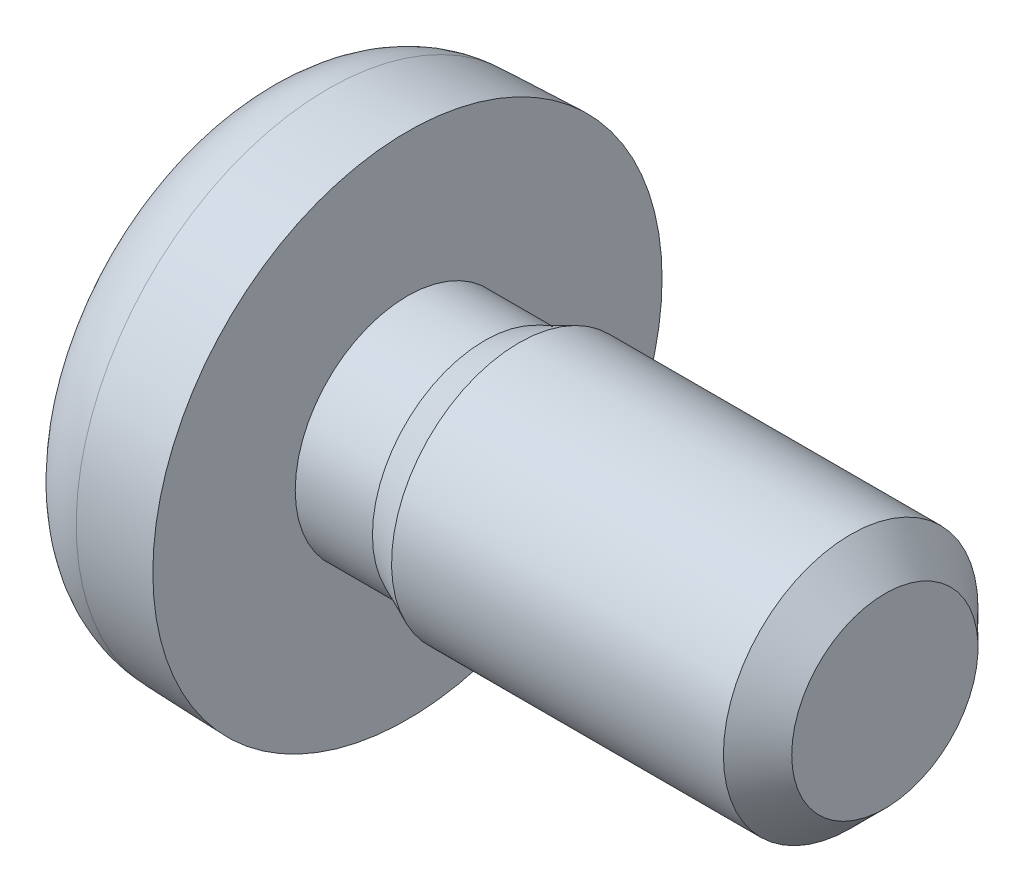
ISO-10303-21;
HEADER;
FILE_DESCRIPTION(('STEP AP214'),'2;1');
FILE_NAME('part.step','',(''),(''),'','','');
FILE_SCHEMA(('AUTOMOTIVE_DESIGN { 1 0 10303 214 1 1 1 1 }'));
ENDSEC;
DATA;
#1=APPLICATION_CONTEXT('core data for automotive mechanical design processes');
#2=APPLICATION_PROTOCOL_DEFINITION('international standard','automotive_design',2000,#1);
#3=PRODUCT_CONTEXT('',#1,'mechanical');
#4=PRODUCT('Part','Part','',(#3));
#5=PRODUCT_RELATED_PRODUCT_CATEGORY('part','',(#4));
#6=PRODUCT_DEFINITION_FORMATION('','',#4);
#7=PRODUCT_DEFINITION_CONTEXT('part definition',#1,'design');
#8=PRODUCT_DEFINITION('design','',#6,#7);
#9=PRODUCT_DEFINITION_SHAPE('','',#8);
#10=(LENGTH_UNIT() NAMED_UNIT(*) SI_UNIT(.MILLI.,.METRE.));
#11=(NAMED_UNIT(*) PLANE_ANGLE_UNIT() SI_UNIT($,.RADIAN.));
#12=(NAMED_UNIT(*) SI_UNIT($,.STERADIAN.) SOLID_ANGLE_UNIT());
#13=UNCERTAINTY_MEASURE_WITH_UNIT(LENGTH_MEASURE(1.E-05),#10,'distance_accuracy_value','');
#14=(GEOMETRIC_REPRESENTATION_CONTEXT(3) GLOBAL_UNCERTAINTY_ASSIGNED_CONTEXT((#13)) GLOBAL_UNIT_ASSIGNED_CONTEXT((#10,
#11,#12)) REPRESENTATION_CONTEXT('',''));
#15=CARTESIAN_POINT('',(0.,0.,0.));
#16=DIRECTION('',(0.,0.,1.));
#17=DIRECTION('',(1.,0.,0.));
#18=AXIS2_PLACEMENT_3D('',#15,#16,#17);
#19=CARTESIAN_POINT('',(-9.33113378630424,-1.33501447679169,-6.9757524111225));
#20=DIRECTION('',(-1.,0.,0.));
#21=DIRECTION('',(0.,0.,1.));
#22=AXIS2_PLACEMENT_3D('',#19,#20,#21);
#23=CONICAL_SURFACE('',#22,0.512107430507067,0.462512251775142);
#24=CARTESIAN_POINT('',(-9.33113378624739,-1.33501447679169,-6.9757524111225));
#25=DIRECTION('',(-1.,0.,0.));
#26=DIRECTION('',(0.,1.,0.));
#27=AXIS2_PLACEMENT_3D('',#24,#25,#26);
#28=CIRCLE('',#27,0.512107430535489);
#29=CARTESIAN_POINT('',(-9.33113378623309,-1.424750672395,-6.47156848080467));
#30=VERTEX_POINT('',#29);
#31=CARTESIAN_POINT('',(-9.33113378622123,-1.24527828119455,-6.47156848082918));
#32=VERTEX_POINT('',#31);
#33=EDGE_CURVE('E505',#30,#32,#28,.T.);
#34=ORIENTED_EDGE('',*,*,#33,.F.);
#35=DIRECTION('',(0.894933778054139,0.0795802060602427,-0.439045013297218));
#36=VECTOR('',#35,1.);
#37=CARTESIAN_POINT('',(-9.83479605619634,-1.46953783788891,-6.22447711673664));
#38=LINE('',#37,#36);
#39=CARTESIAN_POINT('',(-9.83479605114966,-1.46953783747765,-6.22447710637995));
#40=VERTEX_POINT('',#39);
#41=EDGE_CURVE('E497',#40,#30,#38,.T.);
#42=ORIENTED_EDGE('',*,*,#41,.F.);
#43=CARTESIAN_POINT('',(-9.83479604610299,-1.33501447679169,-6.9757524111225));
#44=DIRECTION('',(1.,0.,0.));
#45=DIRECTION('',(0.,0.,-1.));
#46=AXIS2_PLACEMENT_3D('',#43,#44,#45);
#47=CIRCLE('',#46,0.763224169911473);
#48=CARTESIAN_POINT('',(-9.83479604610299,-1.2004911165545,-6.22447710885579));
#49=VERTEX_POINT('',#48);
#50=EDGE_CURVE('E553',#49,#40,#47,.T.);
#51=ORIENTED_EDGE('',*,*,#50,.F.);
#52=DIRECTION('',(-0.894933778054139,0.0795802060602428,0.439045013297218));
#53=VECTOR('',#52,1.);
#54=CARTESIAN_POINT('',(-9.33113378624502,-1.24527828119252,-6.47156848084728));
#55=LINE('',#54,#53);
#56=EDGE_CURVE('E322',#32,#49,#55,.T.);
#57=ORIENTED_EDGE('',*,*,#56,.F.);
#58=EDGE_LOOP('',(#34,#42,#51,#57));
#59=FACE_BOUND('',#58,.T.);
#60=ADVANCED_FACE('F16',(#59),#23,.F.);
#61=CARTESIAN_POINT('',(-9.33113378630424,-1.33501447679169,-6.9757524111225));
#62=DIRECTION('',(-1.,0.,0.));
#63=DIRECTION('',(0.,0.,1.));
#64=AXIS2_PLACEMENT_3D('',#61,#62,#63);
#65=CONICAL_SURFACE('',#64,0.512107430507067,0.462512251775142);
#66=CARTESIAN_POINT('',(-9.33113378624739,-1.33501447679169,-6.9757524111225));
#67=DIRECTION('',(-1.,0.,0.));
#68=DIRECTION('',(0.,1.,0.));
#69=AXIS2_PLACEMENT_3D('',#66,#67,#68);
#70=CIRCLE('',#69,0.512107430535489);
#71=CARTESIAN_POINT('',(-9.33113378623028,-1.83919840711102,-7.06548860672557));
#72=VERTEX_POINT('',#71);
#73=CARTESIAN_POINT('',(-9.33113378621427,-1.83919840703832,-6.8860162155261));
#74=VERTEX_POINT('',#73);
#75=EDGE_CURVE('E172',#72,#74,#70,.T.);
#76=ORIENTED_EDGE('',*,*,#75,.F.);
#77=DIRECTION('',(0.89493377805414,0.439045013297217,0.0795802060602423));
#78=VECTOR('',#77,1.);
#79=CARTESIAN_POINT('',(-9.83479605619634,-2.08628977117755,-7.11027577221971));
#80=LINE('',#79,#78);
#81=CARTESIAN_POINT('',(-9.83479605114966,-2.08628978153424,-7.11027577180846));
#82=VERTEX_POINT('',#81);
#83=EDGE_CURVE('E564',#82,#72,#80,.T.);
#84=ORIENTED_EDGE('',*,*,#83,.F.);
#85=CARTESIAN_POINT('',(-9.83479604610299,-1.33501447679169,-6.9757524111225));
#86=DIRECTION('',(1.,0.,0.));
#87=DIRECTION('',(0.,0.,-1.));
#88=AXIS2_PLACEMENT_3D('',#85,#86,#87);
#89=CIRCLE('',#88,0.763224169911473);
#90=CARTESIAN_POINT('',(-9.83479604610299,-2.0862897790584,-6.84122905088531));
#91=VERTEX_POINT('',#90);
#92=EDGE_CURVE('E455',#91,#82,#89,.T.);
#93=ORIENTED_EDGE('',*,*,#92,.F.);
#94=DIRECTION('',(-0.89493377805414,-0.439045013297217,0.0795802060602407));
#95=VECTOR('',#94,1.);
#96=CARTESIAN_POINT('',(-9.33113378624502,-1.83919840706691,-6.88601621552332));
#97=LINE('',#96,#95);
#98=EDGE_CURVE('E483',#74,#91,#97,.T.);
#99=ORIENTED_EDGE('',*,*,#98,.F.);
#100=EDGE_LOOP('',(#76,#84,#93,#99));
#101=FACE_BOUND('',#100,.T.);
#102=ADVANCED_FACE('F583',(#101),#65,.F.);
#103=CARTESIAN_POINT('',(-9.33113378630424,-1.33501447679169,-6.9757524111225));
#104=DIRECTION('',(-1.,0.,0.));
#105=DIRECTION('',(0.,0.,1.));
#106=AXIS2_PLACEMENT_3D('',#103,#104,#105);
#107=CONICAL_SURFACE('',#106,0.512107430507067,0.462512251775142);
#108=CARTESIAN_POINT('',(-9.33113378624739,-1.33501447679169,-6.9757524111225));
#109=DIRECTION('',(-1.,0.,0.));
#110=DIRECTION('',(0.,1.,0.));
#111=AXIS2_PLACEMENT_3D('',#108,#109,#110);
#112=CIRCLE('',#111,0.512107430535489);
#113=CARTESIAN_POINT('',(-9.33113378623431,-1.24527828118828,-7.47993634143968));
#114=VERTEX_POINT('',#113);
#115=CARTESIAN_POINT('',(-9.33113378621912,-1.42475067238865,-7.47993634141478));
#116=VERTEX_POINT('',#115);
#117=EDGE_CURVE('E503',#114,#116,#112,.T.);
#118=ORIENTED_EDGE('',*,*,#117,.F.);
#119=DIRECTION('',(0.89493377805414,-0.0795802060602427,0.439045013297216));
#120=VECTOR('',#119,1.);
#121=CARTESIAN_POINT('',(-9.83479605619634,-1.20049111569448,-7.72702770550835));
#122=LINE('',#121,#120);
#123=CARTESIAN_POINT('',(-9.83479605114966,-1.20049111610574,-7.72702771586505));
#124=VERTEX_POINT('',#123);
#125=EDGE_CURVE('E422',#124,#114,#122,.T.);
#126=ORIENTED_EDGE('',*,*,#125,.F.);
#127=CARTESIAN_POINT('',(-9.83479604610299,-1.33501447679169,-6.9757524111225));
#128=DIRECTION('',(1.,0.,0.));
#129=DIRECTION('',(0.,0.,-1.));
#130=AXIS2_PLACEMENT_3D('',#127,#128,#129);
#131=CIRCLE('',#130,0.763224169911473);
#132=CARTESIAN_POINT('',(-9.83479604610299,-1.46953783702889,-7.7270277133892));
#133=VERTEX_POINT('',#132);
#134=EDGE_CURVE('E416',#133,#124,#131,.T.);
#135=ORIENTED_EDGE('',*,*,#134,.F.);
#136=DIRECTION('',(-0.89493377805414,-0.0795802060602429,-0.439045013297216));
#137=VECTOR('',#136,1.);
#138=CARTESIAN_POINT('',(-9.33113378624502,-1.42475067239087,-7.47993634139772));
#139=LINE('',#138,#137);
#140=EDGE_CURVE('E395',#116,#133,#139,.T.);
#141=ORIENTED_EDGE('',*,*,#140,.F.);
#142=EDGE_LOOP('',(#118,#126,#135,#141));
#143=FACE_BOUND('',#142,.T.);
#144=ADVANCED_FACE('F331',(#143),#107,.F.);
#145=CARTESIAN_POINT('',(-9.0588414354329,-1.33501447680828,-6.9757524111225));
#146=DIRECTION('',(-1.,0.,0.));
#147=DIRECTION('',(0.,0.,1.));
#148=AXIS2_PLACEMENT_3D('',#145,#146,#147);
#149=CONICAL_SURFACE('',#148,0.,1.0821041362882);
#150=CARTESIAN_POINT('',(-9.0588414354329,-1.33501447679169,-6.9757524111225));
#151=VERTEX_POINT('',#150);
#152=VERTEX_LOOP('',#151);
#153=FACE_BOUND('',#152,.T.);
#154=CARTESIAN_POINT('',(-9.33113378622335,-1.8391984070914,-7.06548860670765));
#155=CARTESIAN_POINT('',(-9.32032341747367,-1.81872506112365,-7.06448297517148));
#156=CARTESIAN_POINT('',(-9.30952005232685,-1.79824798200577,-7.06347794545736));
#157=CARTESIAN_POINT('',(-9.2879381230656,-1.75728076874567,-7.06147001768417));
#158=CARTESIAN_POINT('',(-9.27715955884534,-1.73679063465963,-7.060467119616));
#159=CARTESIAN_POINT('',(-9.25563789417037,-1.69579147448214,-7.05846437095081));
#160=CARTESIAN_POINT('',(-9.24489479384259,-1.67528244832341,-7.05746452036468));
#161=CARTESIAN_POINT('',(-9.2234740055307,-1.63422989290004,-7.05547044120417));
#162=CARTESIAN_POINT('',(-9.21279631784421,-1.61368636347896,-7.05447621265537));
#163=CARTESIAN_POINT('',(-9.20216634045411,-1.59311783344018,-7.05348608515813));
#164=B_SPLINE_CURVE_WITH_KNOTS('',3,(#154,#155,#156,#157,#158,#159,#160,#161,#162,#163),
.UNSPECIFIED.,.F.,.F.,(4,2,2,2,4),(0.,0.0695219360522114,0.139043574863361,0.208565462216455,
0.278087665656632),.UNSPECIFIED.);
#165=CARTESIAN_POINT('',(-9.20216634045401,-1.59311783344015,-7.05348608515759));
#166=VERTEX_POINT('',#165);
#167=EDGE_CURVE('E566',#72,#166,#164,.T.);
#168=ORIENTED_EDGE('',*,*,#167,.F.);
#169=ORIENTED_EDGE('',*,*,#75,.T.);
#170=CARTESIAN_POINT('',(-9.20216634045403,-1.5931178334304,-6.89801873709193));
#171=CARTESIAN_POINT('',(-9.21279631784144,-1.61368636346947,-6.89702860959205));
#172=CARTESIAN_POINT('',(-9.22347400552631,-1.63422989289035,-6.8960343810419));
#173=CARTESIAN_POINT('',(-9.24489479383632,-1.67528244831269,-6.89404030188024));
#174=CARTESIAN_POINT('',(-9.25563789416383,-1.6957914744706,-6.89304045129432));
#175=CARTESIAN_POINT('',(-9.27715955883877,-1.73679063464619,-6.89103770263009));
#176=CARTESIAN_POINT('',(-9.28793812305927,-1.75728076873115,-6.89003480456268));
#177=CARTESIAN_POINT('',(-9.3095200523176,-1.79824798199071,-6.88802687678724));
#178=CARTESIAN_POINT('',(-9.32032341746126,-1.81872506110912,-6.8870218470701));
#179=CARTESIAN_POINT('',(-9.33113378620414,-1.83919840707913,-6.88601621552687));
#180=B_SPLINE_CURVE_WITH_KNOTS('',3,(#170,#171,#172,#173,#174,#175,#176,#177,#178,#179),
.UNSPECIFIED.,.F.,.F.,(4,2,2,2,4),(0.,0.0695222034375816,0.139044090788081,0.208565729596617,
0.278087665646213),.UNSPECIFIED.);
#181=CARTESIAN_POINT('',(-9.20216634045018,-1.59311783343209,-6.89801873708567));
#182=VERTEX_POINT('',#181);
#183=EDGE_CURVE('E346',#182,#74,#180,.T.);
#184=ORIENTED_EDGE('',*,*,#183,.F.);
#185=CARTESIAN_POINT('',(-9.20216634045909,-1.41274815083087,-6.7176490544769));
#186=CARTESIAN_POINT('',(-9.19666714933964,-1.41223975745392,-6.7283676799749));
#187=CARTESIAN_POINT('',(-9.19120015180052,-1.4126860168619,-6.73921822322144));
#188=CARTESIAN_POINT('',(-9.18075429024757,-1.41565272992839,-6.76103489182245));
#189=CARTESIAN_POINT('',(-9.17578252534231,-1.41819951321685,-6.77200073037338));
#190=CARTESIAN_POINT('',(-9.16847089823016,-1.42426349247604,-6.78982249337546));
#191=CARTESIAN_POINT('',(-9.16581951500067,-1.42712711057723,-6.79677103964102));
#192=CARTESIAN_POINT('',(-9.16122099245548,-1.43384913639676,-6.81038828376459));
#193=CARTESIAN_POINT('',(-9.15927066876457,-1.43770290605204,-6.8170581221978));
#194=CARTESIAN_POINT('',(-9.15654218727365,-1.4457713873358,-6.82900575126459));
#195=CARTESIAN_POINT('',(-9.15563425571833,-1.44985073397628,-6.83434441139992));
#196=CARTESIAN_POINT('',(-9.15464404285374,-1.45866827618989,-6.84453369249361));
#197=CARTESIAN_POINT('',(-9.15456139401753,-1.46340617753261,-6.84938452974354));
#198=CARTESIAN_POINT('',(-9.15523394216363,-1.47339449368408,-6.8584432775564));
#199=CARTESIAN_POINT('',(-9.15598815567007,-1.47864430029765,-6.8626519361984));
#200=CARTESIAN_POINT('',(-9.15822287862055,-1.48950278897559,-6.87035492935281));
#201=CARTESIAN_POINT('',(-9.15970434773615,-1.49511193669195,-6.87384831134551));
#202=CARTESIAN_POINT('',(-9.16388971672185,-1.50870224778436,-6.88127822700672));
#203=CARTESIAN_POINT('',(-9.16684373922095,-1.5167834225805,-6.88488884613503));
#204=CARTESIAN_POINT('',(-9.17342619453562,-1.53316038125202,-6.89079812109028));
#205=CARTESIAN_POINT('',(-9.17705662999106,-1.54145673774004,-6.89309279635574));
#206=CARTESIAN_POINT('',(-9.18421980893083,-1.55703609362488,-6.89622465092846));
#207=CARTESIAN_POINT('',(-9.18770497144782,-1.56431206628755,-6.89721142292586));
#208=CARTESIAN_POINT('',(-9.19483662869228,-1.57878016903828,-6.89827581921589));
#209=CARTESIAN_POINT('',(-9.19848161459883,-1.58597250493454,-6.89836063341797));
#210=CARTESIAN_POINT('',(-9.20216634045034,-1.59311783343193,-6.8980187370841));
#211=B_SPLINE_CURVE_WITH_KNOTS('',3,(#185,#186,#187,#188,#189,#190,#191,#192,#193,#194,#195,
#196,#197,#198,#199,#200,#201,#202,#203,#204,#205,#206,#207,#208,#209,#210),.UNSPECIFIED.,.F.,
.F.,(4,2,2,2,2,2,2,2,2,2,2,2,4),(0.,0.0362398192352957,0.0729409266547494,0.0967706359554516,
0.120490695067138,0.140739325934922,0.160978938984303,0.181194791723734,0.201437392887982,
0.229278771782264,0.257203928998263,0.281534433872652,0.305670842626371),.UNSPECIFIED.);
#212=CARTESIAN_POINT('',(-9.20216634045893,-1.4127481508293,-6.71764905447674));
#213=VERTEX_POINT('',#212);
#214=EDGE_CURVE('E353',#213,#182,#211,.T.);
#215=ORIENTED_EDGE('',*,*,#214,.F.);
#216=CARTESIAN_POINT('',(-9.33113378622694,-1.42475067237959,-6.47156848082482));
#217=CARTESIAN_POINT('',(-9.32032341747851,-1.42374504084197,-6.49204182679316));
#218=CARTESIAN_POINT('',(-9.30952005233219,-1.42274001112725,-6.51251890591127));
#219=CARTESIAN_POINT('',(-9.28793812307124,-1.42073208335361,-6.55348611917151));
#220=CARTESIAN_POINT('',(-9.27715955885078,-1.4197291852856,-6.57397625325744));
#221=CARTESIAN_POINT('',(-9.25563789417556,-1.41772643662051,-6.6149754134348));
#222=CARTESIAN_POINT('',(-9.24489479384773,-1.41672658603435,-6.63548443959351));
#223=CARTESIAN_POINT('',(-9.22347400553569,-1.41473250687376,-6.6765369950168));
#224=CARTESIAN_POINT('',(-9.21279631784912,-1.41373827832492,-6.69708052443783));
#225=CARTESIAN_POINT('',(-9.20216634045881,-1.41274815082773,-6.7176490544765));
#226=B_SPLINE_CURVE_WITH_KNOTS('',3,(#216,#217,#218,#219,#220,#221,#222,#223,#224,#225),
.UNSPECIFIED.,.F.,.F.,(4,2,2,2,4),(0.,0.0695219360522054,0.13904357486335,0.20856546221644,
0.278087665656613),.UNSPECIFIED.);
#227=EDGE_CURVE('E359',#30,#213,#226,.T.);
#228=ORIENTED_EDGE('',*,*,#227,.F.);
#229=ORIENTED_EDGE('',*,*,#33,.T.);
#230=CARTESIAN_POINT('',(-9.20216634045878,-1.25728080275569,-6.71764905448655));
#231=CARTESIAN_POINT('',(-9.21279631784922,-1.25629067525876,-6.6970805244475));
#232=CARTESIAN_POINT('',(-9.22347400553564,-1.25529644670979,-6.67653699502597));
#233=CARTESIAN_POINT('',(-9.24489479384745,-1.25330236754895,-6.63548443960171));
#234=CARTESIAN_POINT('',(-9.2556378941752,-1.25230251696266,-6.61497541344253));
#235=CARTESIAN_POINT('',(-9.27715955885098,-1.25029976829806,-6.57397625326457));
#236=CARTESIAN_POINT('',(-9.28793812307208,-1.24929687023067,-6.55348611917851));
#237=CARTESIAN_POINT('',(-9.30952005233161,-1.24728894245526,-6.51251890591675));
#238=CARTESIAN_POINT('',(-9.32032341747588,-1.24628391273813,-6.49204182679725));
#239=CARTESIAN_POINT('',(-9.3311337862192,-1.24527828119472,-6.47156848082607));
#240=B_SPLINE_CURVE_WITH_KNOTS('',3,(#230,#231,#232,#233,#234,#235,#236,#237,#238,#239),
.UNSPECIFIED.,.F.,.F.,(4,2,2,2,4),(0.,0.0695222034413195,0.139044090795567,0.208565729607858,
0.278087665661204),.UNSPECIFIED.);
#241=CARTESIAN_POINT('',(-9.20216634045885,-1.25728080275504,-6.71764905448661));
#242=VERTEX_POINT('',#241);
#243=EDGE_CURVE('E315',#242,#32,#240,.T.);
#244=ORIENTED_EDGE('',*,*,#243,.F.);
#245=CARTESIAN_POINT('',(-9.20216634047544,-1.07691112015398,-6.89801873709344));
#246=CARTESIAN_POINT('',(-9.19666714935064,-1.08762974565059,-6.89852713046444));
#247=CARTESIAN_POINT('',(-9.19120015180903,-1.09848028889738,-6.89808087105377));
#248=CARTESIAN_POINT('',(-9.18075429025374,-1.12029695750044,-6.89511415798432));
#249=CARTESIAN_POINT('',(-9.17578252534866,-1.13126279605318,-6.89256737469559));
#250=CARTESIAN_POINT('',(-9.16847089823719,-1.14908455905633,-6.88650339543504));
#251=CARTESIAN_POINT('',(-9.16581951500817,-1.15603310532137,-6.88363977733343));
#252=CARTESIAN_POINT('',(-9.16122099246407,-1.16965034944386,-6.87691775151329));
#253=CARTESIAN_POINT('',(-9.15927066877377,-1.17632018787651,-6.87306398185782));
#254=CARTESIAN_POINT('',(-9.15654218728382,-1.18826781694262,-6.86499550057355));
#255=CARTESIAN_POINT('',(-9.15563425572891,-1.19360647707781,-6.86091615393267));
#256=CARTESIAN_POINT('',(-9.15464404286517,-1.20379575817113,-6.85209861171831));
#257=CARTESIAN_POINT('',(-9.1545613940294,-1.20864659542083,-6.84736071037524));
#258=CARTESIAN_POINT('',(-9.1552339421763,-1.21770534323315,-6.83737239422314));
#259=CARTESIAN_POINT('',(-9.15598815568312,-1.22191400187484,-6.83212258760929));
#260=CARTESIAN_POINT('',(-9.15822287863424,-1.22961699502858,-6.82126409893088));
#261=CARTESIAN_POINT('',(-9.15970434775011,-1.23311037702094,-6.81565495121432));
#262=CARTESIAN_POINT('',(-9.1638897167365,-1.24054029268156,-6.80206464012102));
#263=CARTESIAN_POINT('',(-9.16684373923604,-1.24415091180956,-6.7939834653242));
#264=CARTESIAN_POINT('',(-9.17342619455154,-1.25006018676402,-6.77760650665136));
#265=CARTESIAN_POINT('',(-9.17705663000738,-1.25235486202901,-6.7693101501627));
#266=CARTESIAN_POINT('',(-9.18421980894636,-1.25548671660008,-6.75373079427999));
#267=CARTESIAN_POINT('',(-9.18770497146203,-1.25647348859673,-6.74645482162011));
#268=CARTESIAN_POINT('',(-9.19483662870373,-1.25753788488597,-6.73198671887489));
#269=CARTESIAN_POINT('',(-9.19848161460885,-1.257622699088,-6.72479438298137));
#270=CARTESIAN_POINT('',(-9.20216634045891,-1.2572808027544,-6.71764905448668));
#271=B_SPLINE_CURVE_WITH_KNOTS('',3,(#245,#246,#247,#248,#249,#250,#251,#252,#253,#254,#255,
#256,#257,#258,#259,#260,#261,#262,#263,#264,#265,#266,#267,#268,#269,#270),.UNSPECIFIED.,.F.,
.F.,(4,2,2,2,2,2,2,2,2,2,2,2,4),(0.,0.0362398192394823,0.0729409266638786,0.0967706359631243,
0.120490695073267,0.140739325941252,0.160978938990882,0.18119479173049,0.201437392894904,
0.229278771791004,0.257203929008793,0.281534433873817,0.305670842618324),.UNSPECIFIED.);
#272=CARTESIAN_POINT('',(-9.20216634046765,-1.07691112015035,-6.89801873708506));
#273=VERTEX_POINT('',#272);
#274=EDGE_CURVE('E179',#273,#242,#271,.T.);
#275=ORIENTED_EDGE('',*,*,#274,.F.);
#276=CARTESIAN_POINT('',(-9.33113378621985,-0.830830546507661,-6.8860162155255));
#277=CARTESIAN_POINT('',(-9.32032341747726,-0.851303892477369,-6.88702184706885));
#278=CARTESIAN_POINT('',(-9.30952005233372,-0.871780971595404,-6.8880268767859));
#279=CARTESIAN_POINT('',(-9.28793812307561,-0.912748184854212,-6.89003480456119));
#280=CARTESIAN_POINT('',(-9.27715955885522,-0.933238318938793,-6.89103770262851));
#281=CARTESIAN_POINT('',(-9.25563789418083,-0.97423747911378,-6.89304045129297));
#282=CARTESIAN_POINT('',(-9.24489479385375,-0.994746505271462,-6.89404030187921));
#283=CARTESIAN_POINT('',(-9.22347400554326,-1.03579906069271,-6.89603438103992));
#284=CARTESIAN_POINT('',(-9.21279631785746,-1.05634259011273,-6.89702860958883));
#285=CARTESIAN_POINT('',(-9.20216634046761,-1.07691112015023,-6.8980187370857));
#286=B_SPLINE_CURVE_WITH_KNOTS('',3,(#276,#277,#278,#279,#280,#281,#282,#283,#284,#285),
.UNSPECIFIED.,.F.,.F.,(4,2,2,2,4),(0.,0.0695219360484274,0.139043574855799,0.208565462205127,
0.278087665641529),.UNSPECIFIED.);
#287=CARTESIAN_POINT('',(-9.33113378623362,-0.830830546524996,-6.88601621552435));
#288=VERTEX_POINT('',#287);
#289=EDGE_CURVE('E175',#288,#273,#286,.T.);
#290=ORIENTED_EDGE('',*,*,#289,.F.);
#291=CARTESIAN_POINT('',(-9.33113378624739,-1.33501447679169,-6.9757524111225));
#292=DIRECTION('',(-1.,0.,0.));
#293=DIRECTION('',(0.,1.,0.));
#294=AXIS2_PLACEMENT_3D('',#291,#292,#293);
#295=CIRCLE('',#294,0.512107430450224);
#296=CARTESIAN_POINT('',(-9.33113378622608,-0.830830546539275,-7.06548860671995));
#297=VERTEX_POINT('',#296);
#298=EDGE_CURVE('E165',#297,#288,#295,.F.);
#299=ORIENTED_EDGE('',*,*,#298,.F.);
#300=CARTESIAN_POINT('',(-9.20216634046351,-1.07691112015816,-7.05348608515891));
#301=CARTESIAN_POINT('',(-9.21279631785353,-1.0563425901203,-7.0544762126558));
#302=CARTESIAN_POINT('',(-9.2234740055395,-1.03579906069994,-7.05547044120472));
#303=CARTESIAN_POINT('',(-9.24489479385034,-0.99474650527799,-7.05746452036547));
#304=CARTESIAN_POINT('',(-9.25563789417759,-0.97423747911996,-7.05846437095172));
#305=CARTESIAN_POINT('',(-9.27715955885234,-0.933238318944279,-7.06046711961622));
#306=CARTESIAN_POINT('',(-9.28793812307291,-0.912748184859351,-7.06147001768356));
#307=CARTESIAN_POINT('',(-9.30952005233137,-0.871780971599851,-7.06347794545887));
#308=CARTESIAN_POINT('',(-9.3203234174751,-0.85130389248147,-7.06448297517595));
#309=CARTESIAN_POINT('',(-9.33113378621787,-0.830830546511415,-7.06548860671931));
#310=B_SPLINE_CURVE_WITH_KNOTS('',3,(#300,#301,#302,#303,#304,#305,#306,#307,#308,#309),
.UNSPECIFIED.,.F.,.F.,(4,2,2,2,4),(0.,0.0695222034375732,0.139044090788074,0.208565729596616,
0.278087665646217),.UNSPECIFIED.);
#311=CARTESIAN_POINT('',(-9.20216634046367,-1.07691112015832,-7.05348608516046));
#312=VERTEX_POINT('',#311);
#313=EDGE_CURVE('E372',#312,#297,#310,.T.);
#314=ORIENTED_EDGE('',*,*,#313,.F.);
#315=CARTESIAN_POINT('',(-9.20216634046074,-1.25728080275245,-7.23385576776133));
#316=CARTESIAN_POINT('',(-9.19666714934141,-1.25778919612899,-7.22313714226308));
#317=CARTESIAN_POINT('',(-9.19120015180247,-1.25734293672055,-7.21228659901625));
#318=CARTESIAN_POINT('',(-9.1807542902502,-1.25437622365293,-7.19046993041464));
#319=CARTESIAN_POINT('',(-9.17578252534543,-1.2518294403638,-7.17950409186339));
#320=CARTESIAN_POINT('',(-9.16847089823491,-1.24576546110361,-7.16168232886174));
#321=CARTESIAN_POINT('',(-9.16581951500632,-1.24290184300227,-7.15473378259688));
#322=CARTESIAN_POINT('',(-9.16122099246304,-1.23617981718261,-7.14111653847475));
#323=CARTESIAN_POINT('',(-9.15927066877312,-1.23232604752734,-7.13444670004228));
#324=CARTESIAN_POINT('',(-9.15654218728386,-1.22425756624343,-7.12249907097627));
#325=CARTESIAN_POINT('',(-9.15563425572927,-1.22017821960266,-7.11716041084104));
#326=CARTESIAN_POINT('',(-9.1546440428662,-1.21136067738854,-7.10697112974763));
#327=CARTESIAN_POINT('',(-9.15456139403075,-1.2066227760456,-7.1021202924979));
#328=CARTESIAN_POINT('',(-9.15523394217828,-1.1966344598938,-7.09306154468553));
#329=CARTESIAN_POINT('',(-9.15598815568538,-1.19138465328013,-7.08885288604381));
#330=CARTESIAN_POINT('',(-9.15822287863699,-1.18052616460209,-7.08114989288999));
#331=CARTESIAN_POINT('',(-9.15970434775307,-1.17491701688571,-7.07765651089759));
#332=CARTESIAN_POINT('',(-9.16388971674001,-1.16132670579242,-7.07022659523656));
#333=CARTESIAN_POINT('',(-9.16684373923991,-1.15324553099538,-7.06661597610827));
#334=CARTESIAN_POINT('',(-9.1734261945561,-1.13686857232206,-7.06070670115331));
#335=CARTESIAN_POINT('',(-9.17705663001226,-1.12857221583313,-7.05841202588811));
#336=CARTESIAN_POINT('',(-9.18421980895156,-1.11299285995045,-7.05528017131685));
#337=CARTESIAN_POINT('',(-9.1877049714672,-1.10571688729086,-7.05429339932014));
#338=CARTESIAN_POINT('',(-9.1948366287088,-1.09124878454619,-7.05322900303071));
#339=CARTESIAN_POINT('',(-9.19848161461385,-1.08405644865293,-7.05314418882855));
#340=CARTESIAN_POINT('',(-9.20216634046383,-1.07691112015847,-7.053486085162));
#341=B_SPLINE_CURVE_WITH_KNOTS('',3,(#315,#316,#317,#318,#319,#320,#321,#322,#323,#324,#325,
#326,#327,#328,#329,#330,#331,#332,#333,#334,#335,#336,#337,#338,#339,#340),.UNSPECIFIED.,.F.,
.F.,(4,2,2,2,2,2,2,2,2,2,2,2,4),(0.,0.0362398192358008,0.072940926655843,0.0967706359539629,
0.12049069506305,0.14073932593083,0.160978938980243,0.181194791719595,0.201437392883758,
0.229278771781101,0.257203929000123,0.281534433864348,0.305670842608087),.UNSPECIFIED.);
#342=CARTESIAN_POINT('',(-9.20216634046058,-1.25728080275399,-7.23385576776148));
#343=VERTEX_POINT('',#342);
#344=EDGE_CURVE('E379',#343,#312,#341,.T.);
#345=ORIENTED_EDGE('',*,*,#344,.F.);
#346=CARTESIAN_POINT('',(-9.33113378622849,-1.24527828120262,-7.4799363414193));
#347=CARTESIAN_POINT('',(-9.32032341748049,-1.24628391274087,-7.45946299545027));
#348=CARTESIAN_POINT('',(-9.30952005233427,-1.24728894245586,-7.43898591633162));
#349=CARTESIAN_POINT('',(-9.28793812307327,-1.24929687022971,-7.39801870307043));
#350=CARTESIAN_POINT('',(-9.27715955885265,-1.25029976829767,-7.37752856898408));
#351=CARTESIAN_POINT('',(-9.25563789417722,-1.25230251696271,-7.33652940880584));
#352=CARTESIAN_POINT('',(-9.24489479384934,-1.2533023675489,-7.31602038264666));
#353=CARTESIAN_POINT('',(-9.22347400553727,-1.25529644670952,-7.2749678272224));
#354=CARTESIAN_POINT('',(-9.21279631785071,-1.25629067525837,-7.25442429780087));
#355=CARTESIAN_POINT('',(-9.20216634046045,-1.25728080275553,-7.23385576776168));
#356=B_SPLINE_CURVE_WITH_KNOTS('',3,(#346,#347,#348,#349,#350,#351,#352,#353,#354,#355),
.UNSPECIFIED.,.F.,.F.,(4,2,2,2,4),(0.,0.0695219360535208,0.139043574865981,0.208565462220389,
0.278087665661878),.UNSPECIFIED.);
#357=EDGE_CURVE('E384',#114,#343,#356,.T.);
#358=ORIENTED_EDGE('',*,*,#357,.F.);
#359=ORIENTED_EDGE('',*,*,#117,.T.);
#360=CARTESIAN_POINT('',(-9.20216634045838,-1.41274815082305,-7.23385576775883));
#361=CARTESIAN_POINT('',(-9.21279631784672,-1.41373827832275,-7.25442429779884));
#362=CARTESIAN_POINT('',(-9.22347400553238,-1.41473250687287,-7.27496782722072));
#363=CARTESIAN_POINT('',(-9.24489479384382,-1.41672658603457,-7.31602038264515));
#364=CARTESIAN_POINT('',(-9.25563789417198,-1.41772643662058,-7.33652940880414));
#365=CARTESIAN_POINT('',(-9.2771595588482,-1.41972918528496,-7.37752856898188));
#366=CARTESIAN_POINT('',(-9.28793812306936,-1.42073208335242,-7.39801870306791));
#367=CARTESIAN_POINT('',(-9.30952005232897,-1.42274001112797,-7.43898591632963));
#368=CARTESIAN_POINT('',(-9.32032341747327,-1.42374504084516,-7.45946299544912));
#369=CARTESIAN_POINT('',(-9.33113378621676,-1.42475067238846,-7.47993634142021));
#370=B_SPLINE_CURVE_WITH_KNOTS('',3,(#360,#361,#362,#363,#364,#365,#366,#367,#368,#369),
.UNSPECIFIED.,.F.,.F.,(4,2,2,2,4),(0.,0.0695222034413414,0.139044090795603,0.208565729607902,
0.27808766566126),.UNSPECIFIED.);
#371=CARTESIAN_POINT('',(-9.20216634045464,-1.41274815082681,-7.23385576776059));
#372=VERTEX_POINT('',#371);
#373=EDGE_CURVE('E389',#372,#116,#370,.T.);
#374=ORIENTED_EDGE('',*,*,#373,.F.);
#375=CARTESIAN_POINT('',(-9.20216634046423,-1.59311783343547,-7.05348608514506));
#376=CARTESIAN_POINT('',(-9.19666714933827,-1.58239920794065,-7.05297769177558));
#377=CARTESIAN_POINT('',(-9.19120015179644,-1.57154866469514,-7.05342395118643));
#378=CARTESIAN_POINT('',(-9.18075429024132,-1.54973199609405,-7.05639066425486));
#379=CARTESIAN_POINT('',(-9.17578252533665,-1.53876615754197,-7.05893744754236));
#380=CARTESIAN_POINT('',(-9.16847089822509,-1.52094439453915,-7.06500142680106));
#381=CARTESIAN_POINT('',(-9.16581951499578,-1.51399584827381,-7.06786504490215));
#382=CARTESIAN_POINT('',(-9.16122099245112,-1.50037860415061,-7.07458707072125));
#383=CARTESIAN_POINT('',(-9.15927066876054,-1.49370876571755,-7.07844084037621));
#384=CARTESIAN_POINT('',(-9.15654218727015,-1.48176113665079,-7.08650932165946));
#385=CARTESIAN_POINT('',(-9.15563425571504,-1.47642247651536,-7.09058866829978));
#386=CARTESIAN_POINT('',(-9.15464404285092,-1.46623319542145,-7.09940621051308));
#387=CARTESIAN_POINT('',(-9.15456139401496,-1.46138235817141,-7.10414411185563));
#388=CARTESIAN_POINT('',(-9.15523394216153,-1.45232361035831,-7.11413242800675));
#389=CARTESIAN_POINT('',(-9.1559881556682,-1.44811495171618,-7.11938223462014));
#390=CARTESIAN_POINT('',(-9.15822287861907,-1.44041195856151,-7.13024072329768));
#391=CARTESIAN_POINT('',(-9.15970434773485,-1.43691857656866,-7.13584987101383));
#392=CARTESIAN_POINT('',(-9.16388971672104,-1.42948866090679,-7.14944018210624));
#393=CARTESIAN_POINT('',(-9.1668437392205,-1.42587804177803,-7.15752135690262));
#394=CARTESIAN_POINT('',(-9.17342619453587,-1.41996876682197,-7.17389831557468));
#395=CARTESIAN_POINT('',(-9.17705662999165,-1.41767409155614,-7.18219467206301));
#396=CARTESIAN_POINT('',(-9.18421980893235,-1.41454223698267,-7.19777402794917));
#397=CARTESIAN_POINT('',(-9.18770497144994,-1.41355546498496,-7.20505000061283));
#398=CARTESIAN_POINT('',(-9.19483662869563,-1.41249106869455,-7.21951810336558));
#399=CARTESIAN_POINT('',(-9.1984816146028,-1.4124062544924,-7.22671043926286));
#400=CARTESIAN_POINT('',(-9.20216634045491,-1.4127481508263,-7.23385576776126));
#401=B_SPLINE_CURVE_WITH_KNOTS('',3,(#375,#376,#377,#378,#379,#380,#381,#382,#383,#384,#385,
#386,#387,#388,#389,#390,#391,#392,#393,#394,#395,#396,#397,#398,#399,#400),.UNSPECIFIED.,.F.,
.F.,(4,2,2,2,2,2,2,2,2,2,2,2,4),(0.,0.0362398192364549,0.072940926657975,0.0967706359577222,
0.12049069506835,0.140739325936,0.160978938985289,0.181194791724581,0.201437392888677,
0.229278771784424,0.257203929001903,0.281534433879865,0.305670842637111),.UNSPECIFIED.);
#402=EDGE_CURVE('E337',#166,#372,#401,.T.);
#403=ORIENTED_EDGE('',*,*,#402,.F.);
#404=EDGE_LOOP('',(#168,#169,#184,#215,#228,#229,#244,#275,#290,#299,#314,#345,#358,#359,#374,#403));
#405=FACE_BOUND('',#404,.T.);
#406=ADVANCED_FACE('F177',(#153,#405),#149,.F.);
#407=CARTESIAN_POINT('',(-9.33113378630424,-1.33501447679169,-6.9757524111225));
#408=DIRECTION('',(-1.,0.,0.));
#409=DIRECTION('',(0.,0.,1.));
#410=AXIS2_PLACEMENT_3D('',#407,#408,#409);
#411=CONICAL_SURFACE('',#410,0.512107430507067,0.462512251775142);
#412=ORIENTED_EDGE('',*,*,#298,.T.);
#413=DIRECTION('',(0.89493377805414,-0.439045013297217,-0.0795802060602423));
#414=VECTOR('',#413,1.);
#415=CARTESIAN_POINT('',(-9.83479605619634,-0.583739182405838,-6.84122905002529));
#416=LINE('',#415,#414);
#417=CARTESIAN_POINT('',(-9.83479598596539,-0.58373920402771,-6.84122905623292));
#418=VERTEX_POINT('',#417);
#419=EDGE_CURVE('E20',#418,#288,#416,.T.);
#420=ORIENTED_EDGE('',*,*,#419,.F.);
#421=CARTESIAN_POINT('',(-9.83479604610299,-1.33501447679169,-6.9757524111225));
#422=DIRECTION('',(1.,0.,0.));
#423=DIRECTION('',(0.,0.,-1.));
#424=AXIS2_PLACEMENT_3D('',#421,#422,#423);
#425=CIRCLE('',#424,0.763224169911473);
#426=CARTESIAN_POINT('',(-9.83479604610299,-0.58373917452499,-7.11027577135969));
#427=VERTEX_POINT('',#426);
#428=EDGE_CURVE('E186',#427,#418,#425,.T.);
#429=ORIENTED_EDGE('',*,*,#428,.F.);
#430=DIRECTION('',(-0.89493377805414,0.439045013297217,-0.0795802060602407));
#431=VECTOR('',#430,1.);
#432=CARTESIAN_POINT('',(-9.33113378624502,-0.830830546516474,-7.06548860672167));
#433=LINE('',#432,#431);
#434=EDGE_CURVE('E168',#297,#427,#433,.T.);
#435=ORIENTED_EDGE('',*,*,#434,.F.);
#436=EDGE_LOOP('',(#412,#420,#429,#435));
#437=FACE_BOUND('',#436,.T.);
#438=ADVANCED_FACE('F167',(#437),#411,.F.);
#439=CARTESIAN_POINT('',(-5.70884143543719,-0.935014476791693,-6.9757524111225));
#440=DIRECTION('',(1.,0.,0.));
#441=DIRECTION('',(0.,0.,-1.));
#442=AXIS2_PLACEMENT_3D('',#439,#440,#441);
#443=PLANE('',#442);
#444=CARTESIAN_POINT('',(-5.70884143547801,-1.33501447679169,-6.9757524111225));
#445=DIRECTION('',(-1.,0.,0.));
#446=DIRECTION('',(0.,0.,1.));
#447=AXIS2_PLACEMENT_3D('',#444,#445,#446);
#448=CIRCLE('',#447,0.585292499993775);
#449=CARTESIAN_POINT('',(-5.70884143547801,-1.33501447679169,-6.39045991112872));
#450=VERTEX_POINT('',#449);
#451=EDGE_CURVE('E185',#450,#450,#448,.T.);
#452=ORIENTED_EDGE('',*,*,#451,.F.);
#453=EDGE_LOOP('',(#452));
#454=FACE_BOUND('',#453,.T.);
#455=ADVANCED_FACE('F638',(#454),#443,.T.);
#456=CARTESIAN_POINT('',(-10.0088414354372,-0.498354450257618,-6.8257524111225));
#457=DIRECTION('',(-0.0871557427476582,0.00291182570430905,-0.996190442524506));
#458=DIRECTION('',(-0.996194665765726,0.,0.0871561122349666));
#459=AXIS2_PLACEMENT_3D('',#456,#457,#458);
#460=PLANE('',#459);
#461=ORIENTED_EDGE('',*,*,#289,.T.);
#462=DIRECTION('',(-0.996194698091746,-0.000254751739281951,0.0871553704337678));
#463=VECTOR('',#462,1.);
#464=CARTESIAN_POINT('',(499000.,126.532142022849,-43664.3597056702));
#465=LINE('',#464,#463);
#466=CARTESIAN_POINT('',(-9.99116849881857,-1.07711288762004,-6.82899028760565));
#467=VERTEX_POINT('',#466);
#468=EDGE_CURVE('E146',#467,#273,#465,.F.);
#469=ORIENTED_EDGE('',*,*,#468,.F.);
#470=CARTESIAN_POINT('',(-9.86456144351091,-0.509351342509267,-6.83840747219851));
#471=CARTESIAN_POINT('',(-9.8966724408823,-0.601507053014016,-6.83586747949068));
#472=CARTESIAN_POINT('',(-9.92327852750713,-0.694898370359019,-6.83381271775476));
#473=CARTESIAN_POINT('',(-9.96548087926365,-0.884152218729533,-6.83067365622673));
#474=CARTESIAN_POINT('',(-9.98107714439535,-0.980014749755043,-6.82958935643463));
#475=CARTESIAN_POINT('',(-9.99116849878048,-1.07711288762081,-6.82899028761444));
#476=B_SPLINE_CURVE_WITH_KNOTS('',3,(#470,#471,#472,#473,#474,#475),.UNSPECIFIED.,.F.,.F.,(4,2,
4),(0.,0.291387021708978,0.582774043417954),.UNSPECIFIED.);
#477=CARTESIAN_POINT('',(-9.86456144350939,-0.509351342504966,-6.83840747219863));
#478=VERTEX_POINT('',#477);
#479=EDGE_CURVE('E143',#478,#467,#476,.T.);
#480=ORIENTED_EDGE('',*,*,#479,.F.);
#481=CARTESIAN_POINT('',(-9.83479591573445,-0.58373922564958,-6.84122906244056));
#482=CARTESIAN_POINT('',(-9.83777850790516,-0.582276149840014,-6.84096384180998));
#483=CARTESIAN_POINT('',(-9.84063128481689,-0.580560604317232,-6.84070924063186));
#484=CARTESIAN_POINT('',(-9.8460060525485,-0.576675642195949,-6.84022765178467));
#485=CARTESIAN_POINT('',(-9.84852845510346,-0.574506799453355,-6.84000062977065));
#486=CARTESIAN_POINT('',(-9.85548943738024,-0.5674055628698,-6.83937086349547));
#487=CARTESIAN_POINT('',(-9.85934197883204,-0.561868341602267,-6.83901762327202));
#488=CARTESIAN_POINT('',(-9.86505664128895,-0.54980326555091,-6.83848238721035));
#489=CARTESIAN_POINT('',(-9.86690182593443,-0.543267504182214,-6.8383018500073));
#490=CARTESIAN_POINT('',(-9.86839785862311,-0.529821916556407,-6.83813166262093));
#491=CARTESIAN_POINT('',(-9.86801099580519,-0.522907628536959,-6.83814529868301));
#492=CARTESIAN_POINT('',(-9.866011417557,-0.513921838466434,-6.83829397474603));
#493=CARTESIAN_POINT('',(-9.86535336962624,-0.511610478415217,-6.83834479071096));
#494=CARTESIAN_POINT('',(-9.86456144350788,-0.509351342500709,-6.83840747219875));
#495=B_SPLINE_CURVE_WITH_KNOTS('',3,(#481,#482,#483,#484,#485,#486,#487,#488,#489,#490,#491,
#492,#493,#494),.UNSPECIFIED.,.F.,.F.,(4,2,2,2,2,2,4),(0.,0.00997412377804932,
0.0199356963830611,0.0397942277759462,0.0598190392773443,0.0801831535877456,0.0873764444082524),.UNSPECIFIED.);
#496=EDGE_CURVE('E181',#418,#478,#495,.T.);
#497=ORIENTED_EDGE('',*,*,#496,.F.);
#498=ORIENTED_EDGE('',*,*,#419,.T.);
#499=EDGE_LOOP('',(#461,#469,#480,#497,#498));
#500=FACE_BOUND('',#499,.T.);
#501=ADVANCED_FACE('F180',(#500),#460,.T.);
#502=CARTESIAN_POINT('',(-9.14964599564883,-1.07743679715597,-6.71817473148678));
#503=DIRECTION('',(1.,0.,0.));
#504=DIRECTION('',(0.,0.,-1.));
#505=AXIS2_PLACEMENT_3D('',#502,#503,#504);
#506=CONICAL_SURFACE('',#505,0.184439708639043,0.0872664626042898);
#507=ORIENTED_EDGE('',*,*,#274,.T.);
#508=DIRECTION('',(0.996194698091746,-0.0871553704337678,0.000254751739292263));
#509=VECTOR('',#508,1.);
#510=CARTESIAN_POINT('',(-9.99116849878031,-1.18825235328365,-6.71785082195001));
#511=LINE('',#510,#509);
#512=CARTESIAN_POINT('',(-9.99116849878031,-1.18825235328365,-6.71785082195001));
#513=VERTEX_POINT('',#512);
#514=EDGE_CURVE('E323',#513,#242,#511,.T.);
#515=ORIENTED_EDGE('',*,*,#514,.F.);
#516=CARTESIAN_POINT('',(-9.99116849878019,-1.07711288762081,-6.82899028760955));
#517=CARTESIAN_POINT('',(-9.99181570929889,-1.08336458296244,-6.82895152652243));
#518=CARTESIAN_POINT('',(-9.99240715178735,-1.08960826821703,-6.82838787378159));
#519=CARTESIAN_POINT('',(-9.99346408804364,-1.10192186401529,-6.82622771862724));
#520=CARTESIAN_POINT('',(-9.99392964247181,-1.10799185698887,-6.82463171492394));
#521=CARTESIAN_POINT('',(-9.99511433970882,-1.12567818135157,-6.8183324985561));
#522=CARTESIAN_POINT('',(-9.99562561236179,-1.13681066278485,-6.81211762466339));
#523=CARTESIAN_POINT('',(-9.99602083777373,-1.15631632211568,-6.79641313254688));
#524=CARTESIAN_POINT('',(-9.99590883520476,-1.1647069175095,-6.78694500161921));
#525=CARTESIAN_POINT('',(-9.99508063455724,-1.17787880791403,-6.76580875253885));
#526=CARTESIAN_POINT('',(-9.99436592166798,-1.18266892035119,-6.7541460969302));
#527=CARTESIAN_POINT('',(-9.99276015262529,-1.18727674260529,-6.73410987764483));
#528=CARTESIAN_POINT('',(-9.99201246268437,-1.18823336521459,-6.72597176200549));
#529=CARTESIAN_POINT('',(-9.99116849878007,-1.18825235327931,-6.71785082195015));
#530=B_SPLINE_CURVE_WITH_KNOTS('',3,(#516,#517,#518,#519,#520,#521,#522,#523,#524,#525,#526,
#527,#528,#529),.UNSPECIFIED.,.F.,.F.,(4,2,2,2,2,2,4),(0.,0.0188126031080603,0.0376161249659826,
0.0751090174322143,0.112358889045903,0.149517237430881,0.173997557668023),.UNSPECIFIED.);
#531=EDGE_CURVE('E213',#467,#513,#530,.T.);
#532=ORIENTED_EDGE('',*,*,#531,.F.);
#533=ORIENTED_EDGE('',*,*,#468,.T.);
#534=EDGE_LOOP('',(#507,#515,#532,#533));
#535=FACE_BOUND('',#534,.T.);
#536=ADVANCED_FACE('F299',(#535),#506,.T.);
#537=CARTESIAN_POINT('',(-10.0088414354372,-1.18670617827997,-6.71785534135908));
#538=DIRECTION('',(-0.0871557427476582,-0.996190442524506,0.00291182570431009));
#539=DIRECTION('',(0.996194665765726,-0.0871561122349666,0.));
#540=AXIS2_PLACEMENT_3D('',#537,#538,#539);
#541=PLANE('',#540);
#542=ORIENTED_EDGE('',*,*,#56,.T.);
#543=CARTESIAN_POINT('',(-9.86456144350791,-1.19766953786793,-6.15008927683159));
#544=CARTESIAN_POINT('',(-9.86570252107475,-1.19757927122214,-6.15336168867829));
#545=CARTESIAN_POINT('',(-9.86656826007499,-1.19751335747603,-6.15672434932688));
#546=CARTESIAN_POINT('',(-9.86772906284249,-1.19743174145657,-6.16354671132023));
#547=CARTESIAN_POINT('',(-9.86802420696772,-1.19741603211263,-6.16700639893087));
#548=CARTESIAN_POINT('',(-9.86802412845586,-1.19744637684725,-6.17738555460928));
#549=CARTESIAN_POINT('',(-9.8668507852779,-1.19756932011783,-6.18432666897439));
#550=CARTESIAN_POINT('',(-9.86226896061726,-1.19800819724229,-6.19733323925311));
#551=CARTESIAN_POINT('',(-9.85888146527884,-1.19832231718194,-6.20340627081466));
#552=CARTESIAN_POINT('',(-9.85030580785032,-1.19910342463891,-6.21395428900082));
#553=CARTESIAN_POINT('',(-9.84514955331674,-1.19956769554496,-6.21845491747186));
#554=CARTESIAN_POINT('',(-9.83791748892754,-1.20021329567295,-6.22285927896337));
#555=CARTESIAN_POINT('',(-9.83637337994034,-1.20035086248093,-6.22370574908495));
#556=CARTESIAN_POINT('',(-9.83479591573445,-1.20049112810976,-6.22447715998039));
#557=B_SPLINE_CURVE_WITH_KNOTS('',3,(#543,#544,#545,#546,#547,#548,#549,#550,#551,#552,#553,
#554,#555,#556),.UNSPECIFIED.,.F.,.F.,(4,2,2,2,2,2,4),(0.,0.0103761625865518,0.0207508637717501,
0.0414352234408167,0.0619263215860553,0.082065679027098,0.0873566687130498),.UNSPECIFIED.);
#558=CARTESIAN_POINT('',(-9.86456145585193,-1.1976695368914,-6.15008931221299));
#559=VERTEX_POINT('',#558);
#560=EDGE_CURVE('E308',#559,#49,#557,.T.);
#561=ORIENTED_EDGE('',*,*,#560,.F.);
#562=CARTESIAN_POINT('',(-9.99116849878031,-1.18825235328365,-6.71785082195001));
#563=CARTESIAN_POINT('',(-9.98107714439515,-1.18885142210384,-6.62075268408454));
#564=CARTESIAN_POINT('',(-9.96548087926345,-1.18993572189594,-6.52489015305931));
#565=CARTESIAN_POINT('',(-9.923278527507,-1.19307478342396,-6.33563630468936));
#566=CARTESIAN_POINT('',(-9.89667244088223,-1.19512954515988,-6.24224498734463));
#567=CARTESIAN_POINT('',(-9.86456144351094,-1.1976695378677,-6.15008927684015));
#568=B_SPLINE_CURVE_WITH_KNOTS('',3,(#562,#563,#564,#565,#566,#567),.UNSPECIFIED.,.F.,.F.,(4,2,
4),(0.,0.291387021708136,0.582774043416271),.UNSPECIFIED.);
#569=EDGE_CURVE('E287',#513,#559,#568,.T.);
#570=ORIENTED_EDGE('',*,*,#569,.F.);
#571=ORIENTED_EDGE('',*,*,#514,.T.);
#572=ORIENTED_EDGE('',*,*,#243,.T.);
#573=EDGE_LOOP('',(#542,#561,#570,#571,#572));
#574=FACE_BOUND('',#573,.T.);
#575=ADVANCED_FACE('F294',(#574),#541,.T.);
#576=CARTESIAN_POINT('',(-9.80802418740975,-1.33501447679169,-6.9757524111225));
#577=DIRECTION('',(1.,0.,0.));
#578=DIRECTION('',(0.,0.,-1.));
#579=AXIS2_PLACEMENT_3D('',#576,#577,#578);
#580=TOROIDAL_SURFACE('',#579,0.81692023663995,0.06);
#581=CARTESIAN_POINT('',(-9.86456144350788,-1.47235941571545,-6.15008927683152));
#582=CARTESIAN_POINT('',(-9.86570252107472,-1.47244968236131,-6.15336168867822));
#583=CARTESIAN_POINT('',(-9.86656826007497,-1.4725155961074,-6.1567243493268));
#584=CARTESIAN_POINT('',(-9.86772906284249,-1.47259721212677,-6.16354671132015));
#585=CARTESIAN_POINT('',(-9.86802420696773,-1.47261292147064,-6.16700639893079));
#586=CARTESIAN_POINT('',(-9.86802412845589,-1.4725825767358,-6.17738555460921));
#587=CARTESIAN_POINT('',(-9.86685078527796,-1.47245963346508,-6.18432666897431));
#588=CARTESIAN_POINT('',(-9.86226896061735,-1.47202075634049,-6.19733323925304));
#589=CARTESIAN_POINT('',(-9.85888146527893,-1.47170663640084,-6.20340627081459));
#590=CARTESIAN_POINT('',(-9.85030580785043,-1.47092552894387,-6.21395428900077));
#591=CARTESIAN_POINT('',(-9.84514955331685,-1.47046125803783,-6.21845491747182));
#592=CARTESIAN_POINT('',(-9.83791748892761,-1.46981565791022,-6.22285927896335));
#593=CARTESIAN_POINT('',(-9.83637337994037,-1.46967809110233,-6.22370574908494));
#594=CARTESIAN_POINT('',(-9.83479591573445,-1.46953782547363,-6.22447715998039));
#595=B_SPLINE_CURVE_WITH_KNOTS('',3,(#581,#582,#583,#584,#585,#586,#587,#588,#589,#590,#591,
#592,#593,#594),.UNSPECIFIED.,.F.,.F.,(4,2,2,2,2,2,4),(0.,0.0103761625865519,0.0207508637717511,
0.041435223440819,0.0619263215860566,0.0820656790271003,0.0873566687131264),.UNSPECIFIED.);
#596=CARTESIAN_POINT('',(-9.86456144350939,-1.47235941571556,-6.15008927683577));
#597=VERTEX_POINT('',#596);
#598=EDGE_CURVE('E551',#597,#40,#595,.T.);
#599=ORIENTED_EDGE('',*,*,#598,.F.);
#600=CARTESIAN_POINT('',(-9.86456146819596,-1.33501447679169,-6.9757524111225));
#601=DIRECTION('',(1.,0.,0.));
#602=DIRECTION('',(0.,0.,-1.));
#603=AXIS2_PLACEMENT_3D('',#600,#601,#602);
#604=CIRCLE('',#603,0.837008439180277);
#605=EDGE_CURVE('E293',#559,#597,#604,.T.);
#606=ORIENTED_EDGE('',*,*,#605,.F.);
#607=ORIENTED_EDGE('',*,*,#560,.T.);
#608=ORIENTED_EDGE('',*,*,#50,.T.);
#609=EDGE_LOOP('',(#599,#606,#607,#608));
#610=FACE_BOUND('',#609,.T.);
#611=ADVANCED_FACE('F298',(#610),#580,.T.);
#612=CARTESIAN_POINT('',(-10.0088414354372,-1.48501447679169,-6.13909238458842));
#613=DIRECTION('',(-0.0871557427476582,0.996190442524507,0.00291182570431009));
#614=DIRECTION('',(-0.996194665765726,-0.0871561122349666,0.));
#615=AXIS2_PLACEMENT_3D('',#612,#613,#614);
#616=PLANE('',#615);
#617=ORIENTED_EDGE('',*,*,#227,.T.);
#618=DIRECTION('',(-0.996194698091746,-0.0871553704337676,-0.000254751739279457));
#619=VECTOR('',#618,1.);
#620=CARTESIAN_POINT('',(499000.,43656.0489387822,120.891404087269));
#621=LINE('',#620,#619);
#622=CARTESIAN_POINT('',(-9.99116849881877,-1.48177660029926,-6.71785082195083));
#623=VERTEX_POINT('',#622);
#624=EDGE_CURVE('E491',#623,#213,#621,.F.);
#625=ORIENTED_EDGE('',*,*,#624,.F.);
#626=CARTESIAN_POINT('',(-9.86456144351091,-1.47235941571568,-6.15008927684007));
#627=CARTESIAN_POINT('',(-9.8966724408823,-1.47489940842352,-6.24224498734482));
#628=CARTESIAN_POINT('',(-9.92327852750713,-1.47695417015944,-6.33563630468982));
#629=CARTESIAN_POINT('',(-9.96548087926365,-1.48009323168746,-6.52489015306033));
#630=CARTESIAN_POINT('',(-9.98107714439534,-1.48117753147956,-6.62075268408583));
#631=CARTESIAN_POINT('',(-9.99116849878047,-1.48177660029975,-6.71785082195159));
#632=B_SPLINE_CURVE_WITH_KNOTS('',3,(#626,#627,#628,#629,#630,#631),.UNSPECIFIED.,.F.,.F.,(4,2,
4),(0.,0.291387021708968,0.582774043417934),.UNSPECIFIED.);
#633=EDGE_CURVE('E281',#597,#623,#632,.T.);
#634=ORIENTED_EDGE('',*,*,#633,.F.);
#635=ORIENTED_EDGE('',*,*,#598,.T.);
#636=ORIENTED_EDGE('',*,*,#41,.T.);
#637=EDGE_LOOP('',(#617,#625,#634,#635,#636));
#638=FACE_BOUND('',#637,.T.);
#639=ADVANCED_FACE('F557',(#638),#616,.T.);
#640=CARTESIAN_POINT('',(-9.14964599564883,-1.59259215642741,-6.71817473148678));
#641=DIRECTION('',(1.,0.,0.));
#642=DIRECTION('',(0.,0.,-1.));
#643=AXIS2_PLACEMENT_3D('',#640,#641,#642);
#644=CONICAL_SURFACE('',#643,0.184439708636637,0.0872664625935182);
#645=ORIENTED_EDGE('',*,*,#214,.T.);
#646=DIRECTION('',(0.996194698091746,-0.000254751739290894,-0.0871553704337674));
#647=VECTOR('',#646,1.);
#648=CARTESIAN_POINT('',(-9.99116849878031,-1.59291606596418,-6.82899028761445));
#649=LINE('',#648,#647);
#650=CARTESIAN_POINT('',(-9.99116849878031,-1.59291606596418,-6.82899028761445));
#651=VERTEX_POINT('',#650);
#652=EDGE_CURVE('E461',#651,#182,#649,.T.);
#653=ORIENTED_EDGE('',*,*,#652,.F.);
#654=CARTESIAN_POINT('',(-9.99116849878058,-1.48177660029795,-6.71785082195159));
#655=CARTESIAN_POINT('',(-9.99181570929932,-1.48181536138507,-6.7241025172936));
#656=CARTESIAN_POINT('',(-9.99240715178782,-1.48237901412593,-6.73034620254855));
#657=CARTESIAN_POINT('',(-9.99346408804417,-1.48453916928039,-6.74265979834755));
#658=CARTESIAN_POINT('',(-9.99392964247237,-1.48613517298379,-6.74872979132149));
#659=CARTESIAN_POINT('',(-9.99511433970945,-1.49243438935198,-6.76641611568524));
#660=CARTESIAN_POINT('',(-9.99562561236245,-1.49864926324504,-6.7775485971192));
#661=CARTESIAN_POINT('',(-9.99602083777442,-1.51435375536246,-6.79705425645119));
#662=CARTESIAN_POINT('',(-9.99590883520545,-1.52382188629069,-6.80544485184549));
#663=CARTESIAN_POINT('',(-9.99508063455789,-1.54495813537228,-6.81861674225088));
#664=CARTESIAN_POINT('',(-9.99436592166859,-1.55662079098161,-6.82340685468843));
#665=CARTESIAN_POINT('',(-9.99276015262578,-1.5766570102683,-6.82801467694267));
#666=CARTESIAN_POINT('',(-9.9920124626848,-1.58479512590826,-6.82897129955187));
#667=CARTESIAN_POINT('',(-9.99116849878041,-1.59291606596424,-6.82899028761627));
#668=B_SPLINE_CURVE_WITH_KNOTS('',3,(#654,#655,#656,#657,#658,#659,#660,#661,#662,#663,#664,
#665,#666,#667),.UNSPECIFIED.,.F.,.F.,(4,2,2,2,2,2,4),(0.,0.0188126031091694,0.0376161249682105,
0.0751090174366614,0.112358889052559,0.149517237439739,0.173997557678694),.UNSPECIFIED.);
#669=EDGE_CURVE('E275',#623,#651,#668,.T.);
#670=ORIENTED_EDGE('',*,*,#669,.F.);
#671=ORIENTED_EDGE('',*,*,#624,.T.);
#672=EDGE_LOOP('',(#645,#653,#670,#671));
#673=FACE_BOUND('',#672,.T.);
#674=ADVANCED_FACE('F559',(#673),#644,.T.);
#675=CARTESIAN_POINT('',(-10.0088414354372,-1.59291154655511,-6.82744411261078));
#676=DIRECTION('',(-0.0871557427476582,-0.00291182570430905,-0.996190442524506));
#677=DIRECTION('',(-0.996194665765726,0.,0.0871561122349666));
#678=AXIS2_PLACEMENT_3D('',#675,#676,#677);
#679=PLANE('',#678);
#680=ORIENTED_EDGE('',*,*,#98,.T.);
#681=CARTESIAN_POINT('',(-9.86456144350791,-2.16067761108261,-6.83840747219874));
#682=CARTESIAN_POINT('',(-9.86570252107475,-2.1574051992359,-6.83831720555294));
#683=CARTESIAN_POINT('',(-9.86656826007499,-2.15404253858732,-6.83825129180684));
#684=CARTESIAN_POINT('',(-9.86772906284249,-2.14722017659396,-6.83816967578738));
#685=CARTESIAN_POINT('',(-9.86802420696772,-2.14376048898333,-6.83815396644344));
#686=CARTESIAN_POINT('',(-9.86802412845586,-2.13338133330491,-6.83818431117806));
#687=CARTESIAN_POINT('',(-9.8668507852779,-2.1264402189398,-6.83830725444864));
#688=CARTESIAN_POINT('',(-9.86226896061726,-2.11343364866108,-6.8387461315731));
#689=CARTESIAN_POINT('',(-9.85888146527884,-2.10736061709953,-6.83906025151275));
#690=CARTESIAN_POINT('',(-9.85030580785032,-2.09681259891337,-6.83984135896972));
#691=CARTESIAN_POINT('',(-9.84514955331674,-2.09231197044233,-6.84030562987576));
#692=CARTESIAN_POINT('',(-9.83791748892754,-2.08790760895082,-6.84095123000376));
#693=CARTESIAN_POINT('',(-9.83637337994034,-2.08706113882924,-6.84108879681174));
#694=CARTESIAN_POINT('',(-9.83479591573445,-2.08628972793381,-6.84122906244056));
#695=B_SPLINE_CURVE_WITH_KNOTS('',3,(#681,#682,#683,#684,#685,#686,#687,#688,#689,#690,#691,
#692,#693,#694),.UNSPECIFIED.,.F.,.F.,(4,2,2,2,2,2,4),(0.,0.0103761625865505,0.0207508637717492,
0.0414352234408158,0.0619263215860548,0.0820656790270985,0.0873566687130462),.UNSPECIFIED.);
#696=CARTESIAN_POINT('',(-9.86456145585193,-2.1606775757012,-6.8384074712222));
#697=VERTEX_POINT('',#696);
#698=EDGE_CURVE('E458',#697,#91,#695,.T.);
#699=ORIENTED_EDGE('',*,*,#698,.F.);
#700=CARTESIAN_POINT('',(-9.99116849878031,-1.59291606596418,-6.82899028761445));
#701=CARTESIAN_POINT('',(-9.98107714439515,-1.69001420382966,-6.82958935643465));
#702=CARTESIAN_POINT('',(-9.96548087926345,-1.78587673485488,-6.83067365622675));
#703=CARTESIAN_POINT('',(-9.923278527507,-1.97513058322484,-6.83381271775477));
#704=CARTESIAN_POINT('',(-9.89667244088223,-2.06852190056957,-6.83586747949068));
#705=CARTESIAN_POINT('',(-9.86456144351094,-2.16067761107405,-6.83840747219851));
#706=B_SPLINE_CURVE_WITH_KNOTS('',3,(#700,#701,#702,#703,#704,#705),.UNSPECIFIED.,.F.,.F.,(4,2,
4),(0.,0.291387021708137,0.582774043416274),.UNSPECIFIED.);
#707=EDGE_CURVE('E268',#651,#697,#706,.T.);
#708=ORIENTED_EDGE('',*,*,#707,.F.);
#709=ORIENTED_EDGE('',*,*,#652,.T.);
#710=ORIENTED_EDGE('',*,*,#183,.T.);
#711=EDGE_LOOP('',(#680,#699,#708,#709,#710));
#712=FACE_BOUND('',#711,.T.);
#713=ADVANCED_FACE('F468',(#712),#679,.T.);
#714=CARTESIAN_POINT('',(-9.80802418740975,-1.33501447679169,-6.9757524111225));
#715=DIRECTION('',(1.,0.,0.));
#716=DIRECTION('',(0.,0.,-1.));
#717=AXIS2_PLACEMENT_3D('',#714,#715,#716);
#718=TOROIDAL_SURFACE('',#717,0.81692023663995,0.06);
#719=CARTESIAN_POINT('',(-9.86456144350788,-2.16067761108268,-7.11309735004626));
#720=CARTESIAN_POINT('',(-9.86570252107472,-2.15740519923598,-7.11318761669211));
#721=CARTESIAN_POINT('',(-9.86656826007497,-2.15404253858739,-7.1132535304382));
#722=CARTESIAN_POINT('',(-9.86772906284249,-2.14722017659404,-7.11333514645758));
#723=CARTESIAN_POINT('',(-9.86802420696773,-2.1437604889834,-7.11335085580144));
#724=CARTESIAN_POINT('',(-9.86802412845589,-2.13338133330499,-7.1133205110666));
#725=CARTESIAN_POINT('',(-9.86685078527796,-2.12644021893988,-7.11319756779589));
#726=CARTESIAN_POINT('',(-9.86226896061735,-2.11343364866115,-7.11275869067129));
#727=CARTESIAN_POINT('',(-9.85888146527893,-2.1073606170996,-7.11244457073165));
#728=CARTESIAN_POINT('',(-9.85030580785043,-2.09681259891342,-7.11166346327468));
#729=CARTESIAN_POINT('',(-9.84514955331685,-2.09231197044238,-7.11119919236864));
#730=CARTESIAN_POINT('',(-9.83791748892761,-2.08790760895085,-7.11055359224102));
#731=CARTESIAN_POINT('',(-9.83637337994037,-2.08706113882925,-7.11041602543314));
#732=CARTESIAN_POINT('',(-9.83479591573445,-2.08628972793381,-7.11027575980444));
#733=B_SPLINE_CURVE_WITH_KNOTS('',3,(#719,#720,#721,#722,#723,#724,#725,#726,#727,#728,#729,
#730,#731,#732),.UNSPECIFIED.,.F.,.F.,(4,2,2,2,2,2,4),(0.,0.010376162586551,0.0207508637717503,
0.0414352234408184,0.0619263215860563,0.0820656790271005,0.0873566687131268),.UNSPECIFIED.);
#734=CARTESIAN_POINT('',(-9.86456144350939,-2.16067761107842,-7.11309735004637));
#735=VERTEX_POINT('',#734);
#736=EDGE_CURVE('E457',#735,#82,#733,.T.);
#737=ORIENTED_EDGE('',*,*,#736,.F.);
#738=CARTESIAN_POINT('',(-9.86456146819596,-1.33501447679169,-6.9757524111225));
#739=DIRECTION('',(1.,0.,0.));
#740=DIRECTION('',(0.,0.,-1.));
#741=AXIS2_PLACEMENT_3D('',#738,#739,#740);
#742=CIRCLE('',#741,0.837008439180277);
#743=EDGE_CURVE('E536',#697,#735,#742,.T.);
#744=ORIENTED_EDGE('',*,*,#743,.F.);
#745=ORIENTED_EDGE('',*,*,#698,.T.);
#746=ORIENTED_EDGE('',*,*,#92,.T.);
#747=EDGE_LOOP('',(#737,#744,#745,#746));
#748=FACE_BOUND('',#747,.T.);
#749=ADVANCED_FACE('F464',(#748),#718,.T.);
#750=CARTESIAN_POINT('',(-10.0088414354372,-2.17167450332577,-7.1257524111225));
#751=DIRECTION('',(-0.0871557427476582,-0.00291182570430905,0.996190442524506));
#752=DIRECTION('',(0.996194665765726,0.,0.0871561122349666));
#753=AXIS2_PLACEMENT_3D('',#750,#751,#752);
#754=PLANE('',#753);
#755=ORIENTED_EDGE('',*,*,#167,.T.);
#756=DIRECTION('',(-0.996194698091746,0.000254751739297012,-0.0871553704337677));
#757=VECTOR('',#756,1.);
#758=CARTESIAN_POINT('',(499000.,-129.202170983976,43650.408200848));
#759=LINE('',#758,#757);
#760=CARTESIAN_POINT('',(-9.99116849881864,-1.59291606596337,-7.12251453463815));
#761=VERTEX_POINT('',#760);
#762=EDGE_CURVE('E500',#761,#166,#759,.F.);
#763=ORIENTED_EDGE('',*,*,#762,.F.);
#764=CARTESIAN_POINT('',(-9.86456144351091,-2.16067761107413,-7.11309735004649));
#765=CARTESIAN_POINT('',(-9.8966724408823,-2.06852190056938,-7.11563734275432));
#766=CARTESIAN_POINT('',(-9.92327852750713,-1.97513058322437,-7.11769210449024));
#767=CARTESIAN_POINT('',(-9.96548087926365,-1.78587673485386,-7.12083116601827));
#768=CARTESIAN_POINT('',(-9.98107714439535,-1.69001420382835,-7.12191546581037));
#769=CARTESIAN_POINT('',(-9.99116849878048,-1.59291606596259,-7.12251453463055));
#770=B_SPLINE_CURVE_WITH_KNOTS('',3,(#764,#765,#766,#767,#768,#769),.UNSPECIFIED.,.F.,.F.,(4,2,
4),(0.,0.291387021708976,0.582774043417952),.UNSPECIFIED.);
#771=EDGE_CURVE('E260',#735,#761,#770,.T.);
#772=ORIENTED_EDGE('',*,*,#771,.F.);
#773=ORIENTED_EDGE('',*,*,#736,.T.);
#774=ORIENTED_EDGE('',*,*,#83,.T.);
#775=EDGE_LOOP('',(#755,#763,#772,#773,#774));
#776=FACE_BOUND('',#775,.T.);
#777=ADVANCED_FACE('F467',(#776),#754,.T.);
#778=CARTESIAN_POINT('',(-9.14964599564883,-1.59259215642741,-7.23333009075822));
#779=DIRECTION('',(1.,0.,0.));
#780=DIRECTION('',(0.,0.,-1.));
#781=AXIS2_PLACEMENT_3D('',#778,#779,#780);
#782=CONICAL_SURFACE('',#781,0.184439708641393,0.0872664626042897);
#783=ORIENTED_EDGE('',*,*,#402,.T.);
#784=DIRECTION('',(0.996194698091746,0.0871553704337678,-0.000254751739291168));
#785=VECTOR('',#784,1.);
#786=CARTESIAN_POINT('',(-9.99116849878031,-1.48177660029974,-7.23365400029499));
#787=LINE('',#786,#785);
#788=CARTESIAN_POINT('',(-9.99116849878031,-1.48177660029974,-7.23365400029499));
#789=VERTEX_POINT('',#788);
#790=EDGE_CURVE('E396',#789,#372,#787,.T.);
#791=ORIENTED_EDGE('',*,*,#790,.F.);
#792=CARTESIAN_POINT('',(-9.99116849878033,-1.59291606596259,-7.12251453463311));
#793=CARTESIAN_POINT('',(-9.99181570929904,-1.58666437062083,-7.12255329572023));
#794=CARTESIAN_POINT('',(-9.99240715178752,-1.58042068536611,-7.12311694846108));
#795=CARTESIAN_POINT('',(-9.99346408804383,-1.56810708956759,-7.12527710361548));
#796=CARTESIAN_POINT('',(-9.99392964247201,-1.56203709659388,-7.12687310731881));
#797=CARTESIAN_POINT('',(-9.99511433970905,-1.5443507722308,-7.13317232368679));
#798=CARTESIAN_POINT('',(-9.99562561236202,-1.53321829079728,-7.13938719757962));
#799=CARTESIAN_POINT('',(-9.99602083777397,-1.51371263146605,-7.15509168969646));
#800=CARTESIAN_POINT('',(-9.995908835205,-1.50532203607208,-7.16455982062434));
#801=CARTESIAN_POINT('',(-9.99508063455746,-1.49215014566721,-7.18569606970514));
#802=CARTESIAN_POINT('',(-9.99436592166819,-1.48736003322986,-7.19735872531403));
#803=CARTESIAN_POINT('',(-9.99276015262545,-1.48275221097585,-7.21739494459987));
#804=CARTESIAN_POINT('',(-9.99201246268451,-1.48179558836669,-7.22553306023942));
#805=CARTESIAN_POINT('',(-9.99116849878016,-1.48177660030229,-7.23365400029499));
#806=B_SPLINE_CURVE_WITH_KNOTS('',3,(#792,#793,#794,#795,#796,#797,#798,#799,#800,#801,#802,
#803,#804,#805),.UNSPECIFIED.,.F.,.F.,(4,2,2,2,2,2,4),(0.,0.0188126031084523,0.0376161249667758,
0.0751090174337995,0.112358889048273,0.149517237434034,0.173997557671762),.UNSPECIFIED.);
#807=EDGE_CURVE('E253',#761,#789,#806,.T.);
#808=ORIENTED_EDGE('',*,*,#807,.F.);
#809=ORIENTED_EDGE('',*,*,#762,.T.);
#810=EDGE_LOOP('',(#783,#791,#808,#809));
#811=FACE_BOUND('',#810,.T.);
#812=ADVANCED_FACE('F403',(#811),#782,.T.);
#813=CARTESIAN_POINT('',(-10.0088414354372,-1.48332277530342,-7.23364948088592));
#814=DIRECTION('',(-0.0871557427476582,0.996190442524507,-0.00291182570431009));
#815=DIRECTION('',(-0.996194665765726,-0.0871561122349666,0.));
#816=AXIS2_PLACEMENT_3D('',#813,#814,#815);
#817=PLANE('',#816);
#818=ORIENTED_EDGE('',*,*,#140,.T.);
#819=CARTESIAN_POINT('',(-9.86456144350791,-1.47235941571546,-7.80141554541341));
#820=CARTESIAN_POINT('',(-9.86570252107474,-1.47244968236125,-7.79814313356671));
#821=CARTESIAN_POINT('',(-9.86656826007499,-1.47251559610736,-7.79478047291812));
#822=CARTESIAN_POINT('',(-9.86772906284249,-1.47259721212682,-7.78795811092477));
#823=CARTESIAN_POINT('',(-9.86802420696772,-1.47261292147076,-7.78449842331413));
#824=CARTESIAN_POINT('',(-9.86802412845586,-1.47258257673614,-7.77411926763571));
#825=CARTESIAN_POINT('',(-9.8668507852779,-1.47245963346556,-7.76717815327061));
#826=CARTESIAN_POINT('',(-9.86226896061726,-1.47202075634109,-7.75417158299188));
#827=CARTESIAN_POINT('',(-9.85888146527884,-1.47170663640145,-7.74809855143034));
#828=CARTESIAN_POINT('',(-9.85030580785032,-1.47092552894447,-7.73755053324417));
#829=CARTESIAN_POINT('',(-9.84514955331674,-1.47046125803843,-7.73304990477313));
#830=CARTESIAN_POINT('',(-9.83791748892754,-1.46981565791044,-7.72864554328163));
#831=CARTESIAN_POINT('',(-9.83637337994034,-1.46967809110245,-7.72779907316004));
#832=CARTESIAN_POINT('',(-9.83479591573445,-1.46953782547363,-7.72702766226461));
#833=B_SPLINE_CURVE_WITH_KNOTS('',3,(#819,#820,#821,#822,#823,#824,#825,#826,#827,#828,#829,
#830,#831,#832),.UNSPECIFIED.,.F.,.F.,(4,2,2,2,2,2,4),(0.,0.0103761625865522,0.0207508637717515,
0.0414352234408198,0.0619263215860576,0.0820656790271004,0.0873566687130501),.UNSPECIFIED.);
#834=CARTESIAN_POINT('',(-9.86456145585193,-1.47235941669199,-7.80141551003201));
#835=VERTEX_POINT('',#834);
#836=EDGE_CURVE('E410',#835,#133,#833,.T.);
#837=ORIENTED_EDGE('',*,*,#836,.F.);
#838=CARTESIAN_POINT('',(-9.99116849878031,-1.48177660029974,-7.23365400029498));
#839=CARTESIAN_POINT('',(-9.98107714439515,-1.48117753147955,-7.33075213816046));
#840=CARTESIAN_POINT('',(-9.96548087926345,-1.48009323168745,-7.42661466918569));
#841=CARTESIAN_POINT('',(-9.92327852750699,-1.47695417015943,-7.61586851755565));
#842=CARTESIAN_POINT('',(-9.89667244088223,-1.47489940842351,-7.70925983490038));
#843=CARTESIAN_POINT('',(-9.86456144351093,-1.47235941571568,-7.80141554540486));
#844=B_SPLINE_CURVE_WITH_KNOTS('',3,(#838,#839,#840,#841,#842,#843),.UNSPECIFIED.,.F.,.F.,(4,2,
4),(0.,0.29138702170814,0.582774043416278),.UNSPECIFIED.);
#845=EDGE_CURVE('E246',#789,#835,#844,.T.);
#846=ORIENTED_EDGE('',*,*,#845,.F.);
#847=ORIENTED_EDGE('',*,*,#790,.T.);
#848=ORIENTED_EDGE('',*,*,#373,.T.);
#849=EDGE_LOOP('',(#818,#837,#846,#847,#848));
#850=FACE_BOUND('',#849,.T.);
#851=ADVANCED_FACE('F398',(#850),#817,.T.);
#852=CARTESIAN_POINT('',(-9.80802418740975,-1.33501447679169,-6.9757524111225));
#853=DIRECTION('',(1.,0.,0.));
#854=DIRECTION('',(0.,0.,-1.));
#855=AXIS2_PLACEMENT_3D('',#852,#853,#854);
#856=TOROIDAL_SURFACE('',#855,0.81692023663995,0.06);
#857=CARTESIAN_POINT('',(-9.86456144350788,-1.19766953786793,-7.80141554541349));
#858=CARTESIAN_POINT('',(-9.86570252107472,-1.19757927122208,-7.79814313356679));
#859=CARTESIAN_POINT('',(-9.86656826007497,-1.19751335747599,-7.7947804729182));
#860=CARTESIAN_POINT('',(-9.86772906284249,-1.19743174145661,-7.78795811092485));
#861=CARTESIAN_POINT('',(-9.86802420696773,-1.19741603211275,-7.78449842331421));
#862=CARTESIAN_POINT('',(-9.86802412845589,-1.19744637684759,-7.77411926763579));
#863=CARTESIAN_POINT('',(-9.86685078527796,-1.19756932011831,-7.76717815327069));
#864=CARTESIAN_POINT('',(-9.86226896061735,-1.1980081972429,-7.75417158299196));
#865=CARTESIAN_POINT('',(-9.85888146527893,-1.19832231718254,-7.74809855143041));
#866=CARTESIAN_POINT('',(-9.85030580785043,-1.19910342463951,-7.73755053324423));
#867=CARTESIAN_POINT('',(-9.84514955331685,-1.19956769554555,-7.73304990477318));
#868=CARTESIAN_POINT('',(-9.83791748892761,-1.20021329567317,-7.72864554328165));
#869=CARTESIAN_POINT('',(-9.83637337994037,-1.20035086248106,-7.72779907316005));
#870=CARTESIAN_POINT('',(-9.83479591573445,-1.20049112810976,-7.72702766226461));
#871=B_SPLINE_CURVE_WITH_KNOTS('',3,(#857,#858,#859,#860,#861,#862,#863,#864,#865,#866,#867,
#868,#869,#870),.UNSPECIFIED.,.F.,.F.,(4,2,2,2,2,2,4),(0.,0.0103761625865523,0.0207508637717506,
0.0414352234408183,0.0619263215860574,0.0820656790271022,0.0873566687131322),.UNSPECIFIED.);
#872=CARTESIAN_POINT('',(-9.86456144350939,-1.19766953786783,-7.80141554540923));
#873=VERTEX_POINT('',#872);
#874=EDGE_CURVE('E417',#873,#124,#871,.T.);
#875=ORIENTED_EDGE('',*,*,#874,.F.);
#876=CARTESIAN_POINT('',(-9.86456146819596,-1.33501447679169,-6.9757524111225));
#877=DIRECTION('',(1.,0.,0.));
#878=DIRECTION('',(0.,0.,-1.));
#879=AXIS2_PLACEMENT_3D('',#876,#877,#878);
#880=CIRCLE('',#879,0.837008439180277);
#881=EDGE_CURVE('E527',#835,#873,#880,.T.);
#882=ORIENTED_EDGE('',*,*,#881,.F.);
#883=ORIENTED_EDGE('',*,*,#836,.T.);
#884=ORIENTED_EDGE('',*,*,#134,.T.);
#885=EDGE_LOOP('',(#875,#882,#883,#884));
#886=FACE_BOUND('',#885,.T.);
#887=ADVANCED_FACE('F402',(#886),#856,.T.);
#888=CARTESIAN_POINT('',(-10.0088414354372,-1.18501447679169,-7.81241243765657));
#889=DIRECTION('',(-0.0871557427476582,-0.996190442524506,-0.00291182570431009));
#890=DIRECTION('',(0.996194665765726,-0.0871561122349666,0.));
#891=AXIS2_PLACEMENT_3D('',#888,#889,#890);
#892=PLANE('',#891);
#893=ORIENTED_EDGE('',*,*,#357,.T.);
#894=DIRECTION('',(-0.996194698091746,0.0871553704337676,0.000254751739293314));
#895=VECTOR('',#894,1.);
#896=CARTESIAN_POINT('',(499000.,-43658.7189677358,-134.842908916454));
#897=LINE('',#896,#895);
#898=CARTESIAN_POINT('',(-9.99116849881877,-1.18825235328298,-7.23365400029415));
#899=VERTEX_POINT('',#898);
#900=EDGE_CURVE('E449',#899,#343,#897,.F.);
#901=ORIENTED_EDGE('',*,*,#900,.F.);
#902=CARTESIAN_POINT('',(-9.86456144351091,-1.1976695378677,-7.80141554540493));
#903=CARTESIAN_POINT('',(-9.8966724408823,-1.19512954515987,-7.70925983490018));
#904=CARTESIAN_POINT('',(-9.92327852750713,-1.19307478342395,-7.61586851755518));
#905=CARTESIAN_POINT('',(-9.96548087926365,-1.18993572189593,-7.42661466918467));
#906=CARTESIAN_POINT('',(-9.98107714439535,-1.18885142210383,-7.33075213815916));
#907=CARTESIAN_POINT('',(-9.99116849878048,-1.18825235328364,-7.2336540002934));
#908=B_SPLINE_CURVE_WITH_KNOTS('',3,(#902,#903,#904,#905,#906,#907),.UNSPECIFIED.,.F.,.F.,(4,2,
4),(0.,0.291387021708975,0.58277404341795),.UNSPECIFIED.);
#909=EDGE_CURVE('E238',#873,#899,#908,.T.);
#910=ORIENTED_EDGE('',*,*,#909,.F.);
#911=ORIENTED_EDGE('',*,*,#874,.T.);
#912=ORIENTED_EDGE('',*,*,#125,.T.);
#913=EDGE_LOOP('',(#893,#901,#910,#911,#912));
#914=FACE_BOUND('',#913,.T.);
#915=ADVANCED_FACE('F423',(#914),#892,.T.);
#916=CARTESIAN_POINT('',(-9.14964599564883,-1.07743679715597,-7.23333009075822));
#917=DIRECTION('',(1.,0.,0.));
#918=DIRECTION('',(0.,0.,-1.));
#919=AXIS2_PLACEMENT_3D('',#916,#917,#918);
#920=CONICAL_SURFACE('',#919,0.184439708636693,0.0872664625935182);
#921=ORIENTED_EDGE('',*,*,#344,.T.);
#922=DIRECTION('',(0.996194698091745,0.000254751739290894,0.0871553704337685));
#923=VECTOR('',#922,1.);
#924=CARTESIAN_POINT('',(-9.99116849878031,-1.07711288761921,-7.12251453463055));
#925=LINE('',#924,#923);
#926=CARTESIAN_POINT('',(-9.99116849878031,-1.07711288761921,-7.12251453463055));
#927=VERTEX_POINT('',#926);
#928=EDGE_CURVE('E447',#927,#312,#925,.T.);
#929=ORIENTED_EDGE('',*,*,#928,.F.);
#930=CARTESIAN_POINT('',(-9.99116849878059,-1.1882523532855,-7.2336540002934));
#931=CARTESIAN_POINT('',(-9.99181570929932,-1.18821359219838,-7.22740230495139));
#932=CARTESIAN_POINT('',(-9.99240715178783,-1.18764993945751,-7.22115861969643));
#933=CARTESIAN_POINT('',(-9.99346408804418,-1.18548978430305,-7.20884502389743));
#934=CARTESIAN_POINT('',(-9.99392964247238,-1.18389378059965,-7.20277503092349));
#935=CARTESIAN_POINT('',(-9.99511433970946,-1.17759456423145,-7.18508870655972));
#936=CARTESIAN_POINT('',(-9.99562561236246,-1.17137969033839,-7.17395622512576));
#937=CARTESIAN_POINT('',(-9.99602083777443,-1.15567519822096,-7.15445056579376));
#938=CARTESIAN_POINT('',(-9.99590883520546,-1.14620706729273,-7.14605997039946));
#939=CARTESIAN_POINT('',(-9.99508063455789,-1.12507081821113,-7.13288807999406));
#940=CARTESIAN_POINT('',(-9.99436592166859,-1.11340816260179,-7.12809796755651));
#941=CARTESIAN_POINT('',(-9.99276015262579,-1.09337194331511,-7.12349014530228));
#942=CARTESIAN_POINT('',(-9.99201246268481,-1.08523382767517,-7.12253352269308));
#943=CARTESIAN_POINT('',(-9.99116849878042,-1.07711288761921,-7.12251453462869));
#944=B_SPLINE_CURVE_WITH_KNOTS('',3,(#930,#931,#932,#933,#934,#935,#936,#937,#938,#939,#940,
#941,#942,#943),.UNSPECIFIED.,.F.,.F.,(4,2,2,2,2,2,4),(0.,0.0188126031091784,0.0376161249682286,
0.075109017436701,0.112358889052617,0.149517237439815,0.173997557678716),.UNSPECIFIED.);
#945=EDGE_CURVE('E231',#899,#927,#944,.T.);
#946=ORIENTED_EDGE('',*,*,#945,.F.);
#947=ORIENTED_EDGE('',*,*,#900,.T.);
#948=EDGE_LOOP('',(#921,#929,#946,#947));
#949=FACE_BOUND('',#948,.T.);
#950=ADVANCED_FACE('F426',(#949),#920,.T.);
#951=CARTESIAN_POINT('',(-10.0088414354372,-1.07711740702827,-7.12406070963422));
#952=DIRECTION('',(-0.0871557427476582,0.00291182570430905,0.996190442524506));
#953=DIRECTION('',(0.996194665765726,0.,0.0871561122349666));
#954=AXIS2_PLACEMENT_3D('',#951,#952,#953);
#955=PLANE('',#954);
#956=ORIENTED_EDGE('',*,*,#434,.T.);
#957=CARTESIAN_POINT('',(-9.86456144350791,-0.509351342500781,-7.11309735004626));
#958=CARTESIAN_POINT('',(-9.86570252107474,-0.512623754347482,-7.11318761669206));
#959=CARTESIAN_POINT('',(-9.86656826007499,-0.515986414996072,-7.11325353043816));
#960=CARTESIAN_POINT('',(-9.86772906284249,-0.522808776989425,-7.11333514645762));
#961=CARTESIAN_POINT('',(-9.86802420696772,-0.526268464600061,-7.11335085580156));
#962=CARTESIAN_POINT('',(-9.86802412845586,-0.536647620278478,-7.11332051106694));
#963=CARTESIAN_POINT('',(-9.8668507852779,-0.543588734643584,-7.11319756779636));
#964=CARTESIAN_POINT('',(-9.86226896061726,-0.556595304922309,-7.1127586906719));
#965=CARTESIAN_POINT('',(-9.85888146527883,-0.562668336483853,-7.11244457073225));
#966=CARTESIAN_POINT('',(-9.85030580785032,-0.573216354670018,-7.11166346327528));
#967=CARTESIAN_POINT('',(-9.84514955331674,-0.57771698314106,-7.11119919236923));
#968=CARTESIAN_POINT('',(-9.83791748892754,-0.582121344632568,-7.11055359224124));
#969=CARTESIAN_POINT('',(-9.83637337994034,-0.582967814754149,-7.11041602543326));
#970=CARTESIAN_POINT('',(-9.83479591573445,-0.583739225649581,-7.11027575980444));
#971=B_SPLINE_CURVE_WITH_KNOTS('',3,(#957,#958,#959,#960,#961,#962,#963,#964,#965,#966,#967,
#968,#969,#970),.UNSPECIFIED.,.F.,.F.,(4,2,2,2,2,2,4),(0.,0.0103761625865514,0.0207508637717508,
0.0414352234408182,0.0619263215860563,0.0820656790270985,0.0873566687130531),.UNSPECIFIED.);
#972=CARTESIAN_POINT('',(-9.86456145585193,-0.509351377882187,-7.1130973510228));
#973=VERTEX_POINT('',#972);
#974=EDGE_CURVE('E35',#973,#427,#971,.T.);
#975=ORIENTED_EDGE('',*,*,#974,.F.);
#976=CARTESIAN_POINT('',(-9.99116849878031,-1.07711288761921,-7.12251453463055));
#977=CARTESIAN_POINT('',(-9.98107714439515,-0.980014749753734,-7.12191546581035));
#978=CARTESIAN_POINT('',(-9.96548087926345,-0.884152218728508,-7.12083116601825));
#979=CARTESIAN_POINT('',(-9.92327852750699,-0.694898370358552,-7.11769210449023));
#980=CARTESIAN_POINT('',(-9.89667244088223,-0.601507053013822,-7.11563734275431));
#981=CARTESIAN_POINT('',(-9.86456144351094,-0.50935134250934,-7.11309735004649));
#982=B_SPLINE_CURVE_WITH_KNOTS('',3,(#976,#977,#978,#979,#980,#981),.UNSPECIFIED.,.F.,.F.,(4,2,
4),(0.,0.291387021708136,0.582774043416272),.UNSPECIFIED.);
#983=EDGE_CURVE('E223',#927,#973,#982,.T.);
#984=ORIENTED_EDGE('',*,*,#983,.F.);
#985=ORIENTED_EDGE('',*,*,#928,.T.);
#986=ORIENTED_EDGE('',*,*,#313,.T.);
#987=EDGE_LOOP('',(#956,#975,#984,#985,#986));
#988=FACE_BOUND('',#987,.T.);
#989=ADVANCED_FACE('F432',(#988),#955,.T.);
#990=CARTESIAN_POINT('',(-9.80802418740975,-1.33501447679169,-6.9757524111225));
#991=DIRECTION('',(1.,0.,0.));
#992=DIRECTION('',(0.,0.,-1.));
#993=AXIS2_PLACEMENT_3D('',#990,#991,#992);
#994=TOROIDAL_SURFACE('',#993,0.81692023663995,0.06);
#995=ORIENTED_EDGE('',*,*,#496,.T.);
#996=CARTESIAN_POINT('',(-9.86456146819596,-1.33501447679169,-6.9757524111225));
#997=DIRECTION('',(1.,0.,0.));
#998=DIRECTION('',(0.,0.,-1.));
#999=AXIS2_PLACEMENT_3D('',#996,#997,#998);
#1000=CIRCLE('',#999,0.837008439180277);
#1001=EDGE_CURVE('E519',#973,#478,#1000,.T.);
#1002=ORIENTED_EDGE('',*,*,#1001,.F.);
#1003=ORIENTED_EDGE('',*,*,#974,.T.);
#1004=ORIENTED_EDGE('',*,*,#428,.T.);
#1005=EDGE_LOOP('',(#995,#1002,#1003,#1004));
#1006=FACE_BOUND('',#1005,.T.);
#1007=ADVANCED_FACE('F188',(#1006),#994,.T.);
#1008=CARTESIAN_POINT('',(-5.92364893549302,-1.33501447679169,-6.9757524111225));
#1009=DIRECTION('',(-1.,0.,0.));
#1010=DIRECTION('',(0.,0.,1.));
#1011=AXIS2_PLACEMENT_3D('',#1008,#1009,#1010);
#1012=CONICAL_SURFACE('',#1011,0.800000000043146,0.785165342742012);
#1013=CARTESIAN_POINT('',(-5.92364893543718,-1.33501447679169,-6.9757524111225));
#1014=DIRECTION('',(1.,0.,0.));
#1015=DIRECTION('',(0.,1.,0.));
#1016=AXIS2_PLACEMENT_3D('',#1013,#1014,#1015);
#1017=CIRCLE('',#1016,0.800000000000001);
#1018=CARTESIAN_POINT('',(-5.92364893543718,-0.535014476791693,-6.9757524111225));
#1019=VERTEX_POINT('',#1018);
#1020=EDGE_CURVE('E518',#1019,#1019,#1017,.F.);
#1021=ORIENTED_EDGE('',*,*,#1020,.F.);
#1022=EDGE_LOOP('',(#1021));
#1023=FACE_BOUND('',#1022,.T.);
#1024=ORIENTED_EDGE('',*,*,#451,.T.);
#1025=EDGE_LOOP('',(#1024));
#1026=FACE_BOUND('',#1025,.T.);
#1027=ADVANCED_FACE('F206',(#1023,#1026),#1012,.T.);
#1028=CARTESIAN_POINT('',(-7.50884143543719,-1.33501447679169,-6.9757524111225));
#1029=DIRECTION('',(0.133559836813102,0.60420893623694,0.785552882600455));
#1030=DIRECTION('',(-0.923059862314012,0.364356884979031,-0.12330673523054));
#1031=AXIS2_PLACEMENT_3D('',#1028,#1029,#1030);
#1032=SPHERICAL_SURFACE('',#1031,2.5);
#1033=CARTESIAN_POINT('',(-9.61068858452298,-1.33501447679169,-6.9757524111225));
#1034=DIRECTION('',(1.,0.,0.));
#1035=DIRECTION('',(0.,0.,-1.));
#1036=AXIS2_PLACEMENT_3D('',#1033,#1034,#1035);
#1037=CIRCLE('',#1036,1.35360206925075);
#1038=CARTESIAN_POINT('',(-9.61068858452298,-1.33501447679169,-8.32935448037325));
#1039=VERTEX_POINT('',#1038);
#1040=EDGE_CURVE('E515',#1039,#1039,#1037,.T.);
#1041=ORIENTED_EDGE('',*,*,#1040,.F.);
#1042=EDGE_LOOP('',(#1041));
#1043=FACE_BOUND('',#1042,.T.);
#1044=ORIENTED_EDGE('',*,*,#983,.T.);
#1045=ORIENTED_EDGE('',*,*,#1001,.T.);
#1046=ORIENTED_EDGE('',*,*,#479,.T.);
#1047=ORIENTED_EDGE('',*,*,#531,.T.);
#1048=ORIENTED_EDGE('',*,*,#569,.T.);
#1049=ORIENTED_EDGE('',*,*,#605,.T.);
#1050=ORIENTED_EDGE('',*,*,#633,.T.);
#1051=ORIENTED_EDGE('',*,*,#669,.T.);
#1052=ORIENTED_EDGE('',*,*,#707,.T.);
#1053=ORIENTED_EDGE('',*,*,#743,.T.);
#1054=ORIENTED_EDGE('',*,*,#771,.T.);
#1055=ORIENTED_EDGE('',*,*,#807,.T.);
#1056=ORIENTED_EDGE('',*,*,#845,.T.);
#1057=ORIENTED_EDGE('',*,*,#881,.T.);
#1058=ORIENTED_EDGE('',*,*,#909,.T.);
#1059=ORIENTED_EDGE('',*,*,#945,.T.);
#1060=EDGE_LOOP('',(#1044,#1045,#1046,#1047,#1048,#1049,#1050,#1051,#1052,#1053,#1054,#1055,
#1056,#1057,#1058,#1059));
#1061=FACE_BOUND('',#1060,.T.);
#1062=ADVANCED_FACE('F200',(#1043,#1061),#1032,.T.);
#1063=CARTESIAN_POINT('',(-6.85884143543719,-1.33501447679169,-6.9757524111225));
#1064=DIRECTION('',(1.,0.,0.));
#1065=DIRECTION('',(0.,1.,0.));
#1066=AXIS2_PLACEMENT_3D('',#1063,#1064,#1065);
#1067=CYLINDRICAL_SURFACE('',#1066,0.800000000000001);
#1068=ORIENTED_EDGE('',*,*,#1020,.T.);
#1069=EDGE_LOOP('',(#1068));
#1070=FACE_BOUND('',#1069,.T.);
#1071=CARTESIAN_POINT('',(-8.00884143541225,-1.33501447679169,-6.9757524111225));
#1072=DIRECTION('',(1.,0.,0.));
#1073=DIRECTION('',(0.,1.,0.));
#1074=AXIS2_PLACEMENT_3D('',#1071,#1072,#1073);
#1075=CIRCLE('',#1074,0.80000000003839);
#1076=CARTESIAN_POINT('',(-8.00884143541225,-0.535014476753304,-6.9757524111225));
#1077=VERTEX_POINT('',#1076);
#1078=EDGE_CURVE('E517',#1077,#1077,#1075,.F.);
#1079=ORIENTED_EDGE('',*,*,#1078,.F.);
#1080=EDGE_LOOP('',(#1079));
#1081=FACE_BOUND('',#1080,.T.);
#1082=ADVANCED_FACE('F205',(#1070,#1081),#1067,.T.);
#1083=CARTESIAN_POINT('',(-9.19031915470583,-1.33501447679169,-6.9757524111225));
#1084=DIRECTION('',(1.,0.,0.));
#1085=DIRECTION('',(0.,0.,-1.));
#1086=AXIS2_PLACEMENT_3D('',#1083,#1084,#1085);
#1087=TOROIDAL_SURFACE('',#1086,1.0828816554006,0.5);
#1088=CARTESIAN_POINT('',(-9.20776890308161,-1.33501447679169,-6.9757524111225));
#1089=DIRECTION('',(1.,0.,0.));
#1090=DIRECTION('',(0.,1.,0.));
#1091=AXIS2_PLACEMENT_3D('',#1088,#1089,#1090);
#1092=CIRCLE('',#1091,1.58257706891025);
#1093=CARTESIAN_POINT('',(-9.20776890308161,0.247562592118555,-6.9757524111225));
#1094=VERTEX_POINT('',#1093);
#1095=EDGE_CURVE('E610',#1094,#1094,#1092,.T.);
#1096=ORIENTED_EDGE('',*,*,#1095,.F.);
#1097=EDGE_LOOP('',(#1096));
#1098=FACE_BOUND('',#1097,.T.);
#1099=ORIENTED_EDGE('',*,*,#1040,.T.);
#1100=EDGE_LOOP('',(#1099));
#1101=FACE_BOUND('',#1100,.T.);
#1102=ADVANCED_FACE('F621',(#1098,#1101),#1087,.T.);
#1103=CARTESIAN_POINT('',(-8.00884143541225,-1.33501447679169,-6.9757524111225));
#1104=DIRECTION('',(1.,0.,0.));
#1105=DIRECTION('',(0.,0.,-1.));
#1106=AXIS2_PLACEMENT_3D('',#1103,#1104,#1105);
#1107=CONICAL_SURFACE('',#1106,0.80000000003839,0.415476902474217);
#1108=ORIENTED_EDGE('',*,*,#1078,.T.);
#1109=EDGE_LOOP('',(#1108));
#1110=FACE_BOUND('',#1109,.T.);
#1111=CARTESIAN_POINT('',(-8.22354893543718,-1.33501447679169,-6.9757524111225));
#1112=DIRECTION('',(1.,0.,0.));
#1113=DIRECTION('',(0.,1.,0.));
#1114=AXIS2_PLACEMENT_3D('',#1111,#1112,#1113);
#1115=CIRCLE('',#1114,0.70528);
#1116=CARTESIAN_POINT('',(-8.22354893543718,-0.629734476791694,-6.9757524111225));
#1117=VERTEX_POINT('',#1116);
#1118=EDGE_CURVE('E514',#1117,#1117,#1115,.F.);
#1119=ORIENTED_EDGE('',*,*,#1118,.F.);
#1120=EDGE_LOOP('',(#1119));
#1121=FACE_BOUND('',#1120,.T.);
#1122=ADVANCED_FACE('F606',(#1110,#1121),#1107,.T.);
#1123=CARTESIAN_POINT('',(-8.70884143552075,-1.33501447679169,-6.9757524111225));
#1124=DIRECTION('',(1.,0.,0.));
#1125=DIRECTION('',(0.,0.,-1.));
#1126=AXIS2_PLACEMENT_3D('',#1123,#1124,#1125);
#1127=CONICAL_SURFACE('',#1126,1.59999999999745,0.0349065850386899);
#1128=CARTESIAN_POINT('',(-8.70884143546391,-1.33501447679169,-6.9757524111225));
#1129=DIRECTION('',(1.,0.,0.));
#1130=DIRECTION('',(0.,0.,-1.));
#1131=AXIS2_PLACEMENT_3D('',#1128,#1129,#1130);
#1132=CIRCLE('',#1131,1.59999999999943);
#1133=CARTESIAN_POINT('',(-8.70884143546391,-1.33501447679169,-8.57575241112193));
#1134=VERTEX_POINT('',#1133);
#1135=EDGE_CURVE('E26',#1134,#1134,#1132,.T.);
#1136=ORIENTED_EDGE('',*,*,#1135,.F.);
#1137=EDGE_LOOP('',(#1136));
#1138=FACE_BOUND('',#1137,.T.);
#1139=ORIENTED_EDGE('',*,*,#1095,.T.);
#1140=EDGE_LOOP('',(#1139));
#1141=FACE_BOUND('',#1140,.T.);
#1142=ADVANCED_FACE('F598',(#1138,#1141),#1127,.T.);
#1143=CARTESIAN_POINT('',(-8.46619518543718,-1.33501447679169,-6.9757524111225));
#1144=DIRECTION('',(1.,0.,0.));
#1145=DIRECTION('',(0.,1.,0.));
#1146=AXIS2_PLACEMENT_3D('',#1143,#1144,#1145);
#1147=CYLINDRICAL_SURFACE('',#1146,0.70528);
#1148=ORIENTED_EDGE('',*,*,#1118,.T.);
#1149=EDGE_LOOP('',(#1148));
#1150=FACE_BOUND('',#1149,.T.);
#1151=CARTESIAN_POINT('',(-8.70884143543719,-1.33501447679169,-6.9757524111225));
#1152=DIRECTION('',(1.,0.,0.));
#1153=DIRECTION('',(0.,1.,0.));
#1154=AXIS2_PLACEMENT_3D('',#1151,#1152,#1153);
#1155=CIRCLE('',#1154,0.70528);
#1156=CARTESIAN_POINT('',(-8.70884143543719,-0.629734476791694,-6.9757524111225));
#1157=VERTEX_POINT('',#1156);
#1158=EDGE_CURVE('E10',#1157,#1157,#1155,.F.);
#1159=ORIENTED_EDGE('',*,*,#1158,.F.);
#1160=EDGE_LOOP('',(#1159));
#1161=FACE_BOUND('',#1160,.T.);
#1162=ADVANCED_FACE('F593',(#1150,#1161),#1147,.T.);
#1163=CARTESIAN_POINT('',(-8.70884143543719,-0.182374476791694,-6.9757524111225));
#1164=DIRECTION('',(1.,0.,0.));
#1165=DIRECTION('',(0.,0.,-1.));
#1166=AXIS2_PLACEMENT_3D('',#1163,#1164,#1165);
#1167=PLANE('',#1166);
#1168=ORIENTED_EDGE('',*,*,#1158,.T.);
#1169=EDGE_LOOP('',(#1168));
#1170=FACE_BOUND('',#1169,.T.);
#1171=ORIENTED_EDGE('',*,*,#1135,.T.);
#1172=EDGE_LOOP('',(#1171));
#1173=FACE_BOUND('',#1172,.T.);
#1174=ADVANCED_FACE('F18',(#1170,#1173),#1167,.T.);
#1175=CLOSED_SHELL('',(#60,#102,#144,#406,#438,#455,#501,#536,#575,#611,#639,#674,#713,#749,
#777,#812,#851,#887,#915,#950,#989,#1007,#1027,#1062,#1082,#1102,#1122,#1142,#1162,#1174));
#1176=MANIFOLD_SOLID_BREP('B1',#1175);
#1177=ADVANCED_BREP_SHAPE_REPRESENTATION('',(#18,#1176),#14);
#1178=SHAPE_DEFINITION_REPRESENTATION(#9,#1177);
ENDSEC;
END-ISO-10303-21;
